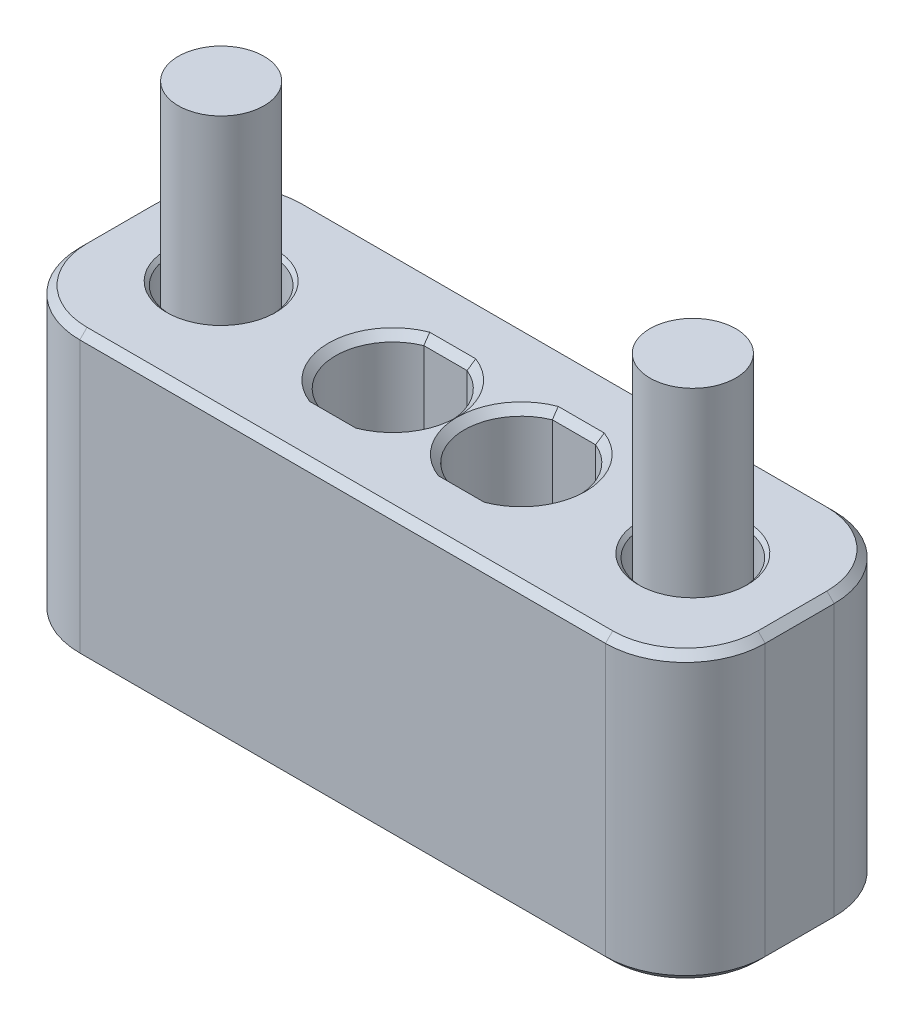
ISO-10303-21;
HEADER;
FILE_DESCRIPTION(('STEP AP214'),'2;1');
FILE_NAME('part.step','',(''),(''),'','','');
FILE_SCHEMA(('AUTOMOTIVE_DESIGN { 1 0 10303 214 1 1 1 1 }'));
ENDSEC;
DATA;
#1=APPLICATION_CONTEXT('core data for automotive mechanical design processes');
#2=APPLICATION_PROTOCOL_DEFINITION('international standard','automotive_design',2000,#1);
#3=PRODUCT_CONTEXT('',#1,'mechanical');
#4=PRODUCT('Part','Part','',(#3));
#5=PRODUCT_RELATED_PRODUCT_CATEGORY('part','',(#4));
#6=PRODUCT_DEFINITION_FORMATION('','',#4);
#7=PRODUCT_DEFINITION_CONTEXT('part definition',#1,'design');
#8=PRODUCT_DEFINITION('design','',#6,#7);
#9=PRODUCT_DEFINITION_SHAPE('','',#8);
#10=(LENGTH_UNIT() NAMED_UNIT(*) SI_UNIT(.MILLI.,.METRE.));
#11=(NAMED_UNIT(*) PLANE_ANGLE_UNIT() SI_UNIT($,.RADIAN.));
#12=(NAMED_UNIT(*) SI_UNIT($,.STERADIAN.) SOLID_ANGLE_UNIT());
#13=UNCERTAINTY_MEASURE_WITH_UNIT(LENGTH_MEASURE(1.E-05),#10,'distance_accuracy_value','');
#14=(GEOMETRIC_REPRESENTATION_CONTEXT(3) GLOBAL_UNCERTAINTY_ASSIGNED_CONTEXT((#13)) GLOBAL_UNIT_ASSIGNED_CONTEXT((#10,
#11,#12)) REPRESENTATION_CONTEXT('',''));
#15=CARTESIAN_POINT('',(0.,0.,0.));
#16=DIRECTION('',(0.,0.,1.));
#17=DIRECTION('',(1.,0.,0.));
#18=AXIS2_PLACEMENT_3D('',#15,#16,#17);
#19=CARTESIAN_POINT('',(16.5,32.112,0.));
#20=DIRECTION('',(0.,1.,0.));
#21=DIRECTION('',(-1.,0.,0.));
#22=AXIS2_PLACEMENT_3D('',#19,#20,#21);
#23=PLANE('',#22);
#24=CARTESIAN_POINT('',(16.5,32.112,0.));
#25=DIRECTION('',(0.,-1.,0.));
#26=DIRECTION('',(-1.,0.,0.));
#27=AXIS2_PLACEMENT_3D('',#24,#25,#26);
#28=CIRCLE('',#27,3.);
#29=CARTESIAN_POINT('',(13.5,32.112,0.));
#30=VERTEX_POINT('',#29);
#31=EDGE_CURVE('E12',#30,#30,#28,.T.);
#32=ORIENTED_EDGE('',*,*,#31,.F.);
#33=EDGE_LOOP('',(#32));
#34=FACE_BOUND('',#33,.T.);
#35=ADVANCED_FACE('F47',(#34),#23,.T.);
#36=CARTESIAN_POINT('',(16.5,32.112,0.));
#37=DIRECTION('',(0.,1.,0.));
#38=DIRECTION('',(-1.,0.,0.));
#39=AXIS2_PLACEMENT_3D('',#36,#37,#38);
#40=CYLINDRICAL_SURFACE('',#39,3.);
#41=CARTESIAN_POINT('',(16.5,7.112,0.));
#42=DIRECTION('',(0.,-1.,0.));
#43=DIRECTION('',(-1.,0.,0.));
#44=AXIS2_PLACEMENT_3D('',#41,#42,#43);
#45=CIRCLE('',#44,3.);
#46=CARTESIAN_POINT('',(13.5,7.112,0.));
#47=VERTEX_POINT('',#46);
#48=EDGE_CURVE('E54',#47,#47,#45,.T.);
#49=ORIENTED_EDGE('',*,*,#48,.F.);
#50=EDGE_LOOP('',(#49));
#51=FACE_BOUND('',#50,.T.);
#52=ORIENTED_EDGE('',*,*,#31,.T.);
#53=EDGE_LOOP('',(#52));
#54=FACE_BOUND('',#53,.T.);
#55=ADVANCED_FACE('F146',(#51,#54),#40,.T.);
#56=CARTESIAN_POINT('',(16.5,7.112,3.));
#57=DIRECTION('',(0.,1.,0.));
#58=DIRECTION('',(-1.,0.,0.));
#59=AXIS2_PLACEMENT_3D('',#56,#57,#58);
#60=PLANE('',#59);
#61=CARTESIAN_POINT('',(16.5,7.112,0.));
#62=DIRECTION('',(0.,-1.,0.));
#63=DIRECTION('',(-1.,0.,0.));
#64=AXIS2_PLACEMENT_3D('',#61,#62,#63);
#65=CIRCLE('',#64,5.);
#66=CARTESIAN_POINT('',(11.5,7.112,0.));
#67=VERTEX_POINT('',#66);
#68=EDGE_CURVE('E139',#67,#67,#65,.T.);
#69=ORIENTED_EDGE('',*,*,#68,.F.);
#70=EDGE_LOOP('',(#69));
#71=FACE_BOUND('',#70,.T.);
#72=ORIENTED_EDGE('',*,*,#48,.T.);
#73=EDGE_LOOP('',(#72));
#74=FACE_BOUND('',#73,.T.);
#75=ADVANCED_FACE('F144',(#71,#74),#60,.T.);
#76=CARTESIAN_POINT('',(16.5,32.112,0.));
#77=DIRECTION('',(0.,1.,0.));
#78=DIRECTION('',(-1.,0.,0.));
#79=AXIS2_PLACEMENT_3D('',#76,#77,#78);
#80=CYLINDRICAL_SURFACE('',#79,5.);
#81=CARTESIAN_POINT('',(16.5,1.112,0.));
#82=DIRECTION('',(0.,-1.,0.));
#83=DIRECTION('',(-1.,0.,0.));
#84=AXIS2_PLACEMENT_3D('',#81,#82,#83);
#85=CIRCLE('',#84,5.);
#86=CARTESIAN_POINT('',(11.5,1.112,0.));
#87=VERTEX_POINT('',#86);
#88=EDGE_CURVE('E136',#87,#87,#85,.T.);
#89=ORIENTED_EDGE('',*,*,#88,.F.);
#90=EDGE_LOOP('',(#89));
#91=FACE_BOUND('',#90,.T.);
#92=ORIENTED_EDGE('',*,*,#68,.T.);
#93=EDGE_LOOP('',(#92));
#94=FACE_BOUND('',#93,.T.);
#95=ADVANCED_FACE('F164',(#91,#94),#80,.T.);
#96=CARTESIAN_POINT('',(16.5,1.112,5.));
#97=DIRECTION('',(0.,-1.,0.));
#98=DIRECTION('',(1.,0.,0.));
#99=AXIS2_PLACEMENT_3D('',#96,#97,#98);
#100=PLANE('',#99);
#101=DIRECTION('',(-0.866025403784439,0.,0.5));
#102=VECTOR('',#101,1.);
#103=CARTESIAN_POINT('',(16.5,1.112,-2.88675134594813));
#104=LINE('',#103,#102);
#105=CARTESIAN_POINT('',(16.5,1.112,-2.88675134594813));
#106=VERTEX_POINT('',#105);
#107=CARTESIAN_POINT('',(14.,1.112,-1.44337567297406));
#108=VERTEX_POINT('',#107);
#109=EDGE_CURVE('E262',#106,#108,#104,.T.);
#110=ORIENTED_EDGE('',*,*,#109,.T.);
#111=DIRECTION('',(0.,0.,1.));
#112=VECTOR('',#111,1.);
#113=CARTESIAN_POINT('',(14.,1.112,-1.44337567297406));
#114=LINE('',#113,#112);
#115=CARTESIAN_POINT('',(14.,1.112,1.44337567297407));
#116=VERTEX_POINT('',#115);
#117=EDGE_CURVE('E256',#108,#116,#114,.T.);
#118=ORIENTED_EDGE('',*,*,#117,.T.);
#119=DIRECTION('',(0.866025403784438,0.,0.5));
#120=VECTOR('',#119,1.);
#121=CARTESIAN_POINT('',(14.,1.112,1.44337567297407));
#122=LINE('',#121,#120);
#123=CARTESIAN_POINT('',(16.5,1.112,2.88675134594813));
#124=VERTEX_POINT('',#123);
#125=EDGE_CURVE('E261',#116,#124,#122,.T.);
#126=ORIENTED_EDGE('',*,*,#125,.T.);
#127=DIRECTION('',(0.866025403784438,0.,-0.5));
#128=VECTOR('',#127,1.);
#129=CARTESIAN_POINT('',(16.5,1.112,2.88675134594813));
#130=LINE('',#129,#128);
#131=CARTESIAN_POINT('',(19.,1.112,1.44337567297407));
#132=VERTEX_POINT('',#131);
#133=EDGE_CURVE('E270',#124,#132,#130,.T.);
#134=ORIENTED_EDGE('',*,*,#133,.T.);
#135=DIRECTION('',(0.,0.,-1.));
#136=VECTOR('',#135,1.);
#137=CARTESIAN_POINT('',(19.,1.112,1.44337567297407));
#138=LINE('',#137,#136);
#139=CARTESIAN_POINT('',(19.,1.112,-1.44337567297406));
#140=VERTEX_POINT('',#139);
#141=EDGE_CURVE('E125',#132,#140,#138,.T.);
#142=ORIENTED_EDGE('',*,*,#141,.T.);
#143=DIRECTION('',(-0.866025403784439,0.,-0.5));
#144=VECTOR('',#143,1.);
#145=CARTESIAN_POINT('',(19.,1.112,-1.44337567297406));
#146=LINE('',#145,#144);
#147=EDGE_CURVE('E265',#140,#106,#146,.T.);
#148=ORIENTED_EDGE('',*,*,#147,.T.);
#149=EDGE_LOOP('',(#110,#118,#126,#134,#142,#148));
#150=FACE_BOUND('',#149,.T.);
#151=ORIENTED_EDGE('',*,*,#88,.T.);
#152=EDGE_LOOP('',(#151));
#153=FACE_BOUND('',#152,.T.);
#154=ADVANCED_FACE('F172',(#150,#153),#100,.T.);
#155=CARTESIAN_POINT('',(16.5,6.112,-2.88675134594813));
#156=DIRECTION('',(-0.5,0.,-0.866025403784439));
#157=DIRECTION('',(0.866025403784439,0.,-0.5));
#158=AXIS2_PLACEMENT_3D('',#155,#156,#157);
#159=PLANE('',#158);
#160=ORIENTED_EDGE('',*,*,#109,.F.);
#161=DIRECTION('',(0.,-1.,0.));
#162=VECTOR('',#161,1.);
#163=CARTESIAN_POINT('',(16.5,6.112,-2.88675134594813));
#164=LINE('',#163,#162);
#165=CARTESIAN_POINT('',(16.5,6.112,-2.88675134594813));
#166=VERTEX_POINT('',#165);
#167=EDGE_CURVE('E92',#166,#106,#164,.T.);
#168=ORIENTED_EDGE('',*,*,#167,.F.);
#169=DIRECTION('',(-0.866025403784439,0.,0.5));
#170=VECTOR('',#169,1.);
#171=CARTESIAN_POINT('',(16.5,6.112,-2.88675134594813));
#172=LINE('',#171,#170);
#173=CARTESIAN_POINT('',(14.,6.112,-1.44337567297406));
#174=VERTEX_POINT('',#173);
#175=EDGE_CURVE('E273',#166,#174,#172,.T.);
#176=ORIENTED_EDGE('',*,*,#175,.T.);
#177=DIRECTION('',(0.,-1.,0.));
#178=VECTOR('',#177,1.);
#179=CARTESIAN_POINT('',(14.,6.112,-1.44337567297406));
#180=LINE('',#179,#178);
#181=EDGE_CURVE('E61',#174,#108,#180,.T.);
#182=ORIENTED_EDGE('',*,*,#181,.T.);
#183=EDGE_LOOP('',(#160,#168,#176,#182));
#184=FACE_BOUND('',#183,.T.);
#185=ADVANCED_FACE('F180',(#184),#159,.F.);
#186=CARTESIAN_POINT('',(19.,6.112,-1.44337567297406));
#187=DIRECTION('',(0.5,0.,-0.866025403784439));
#188=DIRECTION('',(0.866025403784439,0.,0.5));
#189=AXIS2_PLACEMENT_3D('',#186,#187,#188);
#190=PLANE('',#189);
#191=ORIENTED_EDGE('',*,*,#147,.F.);
#192=DIRECTION('',(0.,-1.,0.));
#193=VECTOR('',#192,1.);
#194=CARTESIAN_POINT('',(19.,6.112,-1.44337567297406));
#195=LINE('',#194,#193);
#196=CARTESIAN_POINT('',(19.,6.112,-1.44337567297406));
#197=VERTEX_POINT('',#196);
#198=EDGE_CURVE('E127',#197,#140,#195,.T.);
#199=ORIENTED_EDGE('',*,*,#198,.F.);
#200=DIRECTION('',(-0.866025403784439,0.,-0.5));
#201=VECTOR('',#200,1.);
#202=CARTESIAN_POINT('',(19.,6.112,-1.44337567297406));
#203=LINE('',#202,#201);
#204=EDGE_CURVE('E70',#197,#166,#203,.T.);
#205=ORIENTED_EDGE('',*,*,#204,.T.);
#206=ORIENTED_EDGE('',*,*,#167,.T.);
#207=EDGE_LOOP('',(#191,#199,#205,#206));
#208=FACE_BOUND('',#207,.T.);
#209=ADVANCED_FACE('F188',(#208),#190,.F.);
#210=CARTESIAN_POINT('',(19.,6.112,1.44337567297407));
#211=DIRECTION('',(1.,0.,0.));
#212=DIRECTION('',(0.,0.,1.));
#213=AXIS2_PLACEMENT_3D('',#210,#211,#212);
#214=PLANE('',#213);
#215=ORIENTED_EDGE('',*,*,#141,.F.);
#216=DIRECTION('',(0.,-1.,0.));
#217=VECTOR('',#216,1.);
#218=CARTESIAN_POINT('',(19.,6.112,1.44337567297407));
#219=LINE('',#218,#217);
#220=CARTESIAN_POINT('',(19.,6.112,1.44337567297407));
#221=VERTEX_POINT('',#220);
#222=EDGE_CURVE('E114',#221,#132,#219,.T.);
#223=ORIENTED_EDGE('',*,*,#222,.F.);
#224=DIRECTION('',(0.,0.,-1.));
#225=VECTOR('',#224,1.);
#226=CARTESIAN_POINT('',(19.,6.112,1.44337567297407));
#227=LINE('',#226,#225);
#228=EDGE_CURVE('E117',#221,#197,#227,.T.);
#229=ORIENTED_EDGE('',*,*,#228,.T.);
#230=ORIENTED_EDGE('',*,*,#198,.T.);
#231=EDGE_LOOP('',(#215,#223,#229,#230));
#232=FACE_BOUND('',#231,.T.);
#233=ADVANCED_FACE('F123',(#232),#214,.F.);
#234=CARTESIAN_POINT('',(16.5,6.112,2.88675134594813));
#235=DIRECTION('',(0.5,0.,0.866025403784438));
#236=DIRECTION('',(-0.866025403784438,0.,0.5));
#237=AXIS2_PLACEMENT_3D('',#234,#235,#236);
#238=PLANE('',#237);
#239=ORIENTED_EDGE('',*,*,#133,.F.);
#240=DIRECTION('',(0.,-1.,0.));
#241=VECTOR('',#240,1.);
#242=CARTESIAN_POINT('',(16.5,6.112,2.88675134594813));
#243=LINE('',#242,#241);
#244=CARTESIAN_POINT('',(16.5,6.112,2.88675134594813));
#245=VERTEX_POINT('',#244);
#246=EDGE_CURVE('E116',#245,#124,#243,.T.);
#247=ORIENTED_EDGE('',*,*,#246,.F.);
#248=DIRECTION('',(0.866025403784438,0.,-0.5));
#249=VECTOR('',#248,1.);
#250=CARTESIAN_POINT('',(16.5,6.112,2.88675134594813));
#251=LINE('',#250,#249);
#252=EDGE_CURVE('E109',#245,#221,#251,.T.);
#253=ORIENTED_EDGE('',*,*,#252,.T.);
#254=ORIENTED_EDGE('',*,*,#222,.T.);
#255=EDGE_LOOP('',(#239,#247,#253,#254));
#256=FACE_BOUND('',#255,.T.);
#257=ADVANCED_FACE('F112',(#256),#238,.F.);
#258=CARTESIAN_POINT('',(14.,6.112,1.44337567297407));
#259=DIRECTION('',(-0.5,0.,0.866025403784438));
#260=DIRECTION('',(-0.866025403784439,0.,-0.5));
#261=AXIS2_PLACEMENT_3D('',#258,#259,#260);
#262=PLANE('',#261);
#263=ORIENTED_EDGE('',*,*,#125,.F.);
#264=DIRECTION('',(0.,-1.,0.));
#265=VECTOR('',#264,1.);
#266=CARTESIAN_POINT('',(14.,6.112,1.44337567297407));
#267=LINE('',#266,#265);
#268=CARTESIAN_POINT('',(14.,6.112,1.44337567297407));
#269=VERTEX_POINT('',#268);
#270=EDGE_CURVE('E130',#269,#116,#267,.T.);
#271=ORIENTED_EDGE('',*,*,#270,.F.);
#272=DIRECTION('',(0.866025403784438,0.,0.5));
#273=VECTOR('',#272,1.);
#274=CARTESIAN_POINT('',(14.,6.112,1.44337567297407));
#275=LINE('',#274,#273);
#276=EDGE_CURVE('E118',#269,#245,#275,.T.);
#277=ORIENTED_EDGE('',*,*,#276,.T.);
#278=ORIENTED_EDGE('',*,*,#246,.T.);
#279=EDGE_LOOP('',(#263,#271,#277,#278));
#280=FACE_BOUND('',#279,.T.);
#281=ADVANCED_FACE('F207',(#280),#262,.F.);
#282=CARTESIAN_POINT('',(14.,6.112,-1.44337567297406));
#283=DIRECTION('',(-1.,0.,0.));
#284=DIRECTION('',(0.,-1.,0.));
#285=AXIS2_PLACEMENT_3D('',#282,#283,#284);
#286=PLANE('',#285);
#287=ORIENTED_EDGE('',*,*,#117,.F.);
#288=ORIENTED_EDGE('',*,*,#181,.F.);
#289=DIRECTION('',(0.,0.,1.));
#290=VECTOR('',#289,1.);
#291=CARTESIAN_POINT('',(14.,6.112,-1.44337567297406));
#292=LINE('',#291,#290);
#293=EDGE_CURVE('E100',#174,#269,#292,.T.);
#294=ORIENTED_EDGE('',*,*,#293,.T.);
#295=ORIENTED_EDGE('',*,*,#270,.T.);
#296=EDGE_LOOP('',(#287,#288,#294,#295));
#297=FACE_BOUND('',#296,.T.);
#298=ADVANCED_FACE('F214',(#297),#286,.F.);
#299=CARTESIAN_POINT('',(11.5,6.112,0.));
#300=DIRECTION('',(0.,-1.,0.));
#301=DIRECTION('',(1.,0.,0.));
#302=AXIS2_PLACEMENT_3D('',#299,#300,#301);
#303=PLANE('',#302);
#304=ORIENTED_EDGE('',*,*,#175,.F.);
#305=ORIENTED_EDGE('',*,*,#204,.F.);
#306=ORIENTED_EDGE('',*,*,#228,.F.);
#307=ORIENTED_EDGE('',*,*,#252,.F.);
#308=ORIENTED_EDGE('',*,*,#276,.F.);
#309=ORIENTED_EDGE('',*,*,#293,.F.);
#310=EDGE_LOOP('',(#304,#305,#306,#307,#308,#309));
#311=FACE_BOUND('',#310,.T.);
#312=ADVANCED_FACE('F120',(#311),#303,.T.);
#313=CLOSED_SHELL('',(#35,#55,#75,#95,#154,#185,#209,#233,#257,#281,#298,#312));
#314=MANIFOLD_SOLID_BREP('B2',#313);
#315=CARTESIAN_POINT('',(-16.5,32.112,0.));
#316=DIRECTION('',(0.,1.,0.));
#317=DIRECTION('',(1.,0.,0.));
#318=AXIS2_PLACEMENT_3D('',#315,#316,#317);
#319=PLANE('',#318);
#320=CARTESIAN_POINT('',(-16.5,32.112,0.));
#321=DIRECTION('',(0.,1.,0.));
#322=DIRECTION('',(1.,0.,0.));
#323=AXIS2_PLACEMENT_3D('',#320,#321,#322);
#324=CIRCLE('',#323,3.);
#325=CARTESIAN_POINT('',(-13.5,32.112,0.));
#326=VERTEX_POINT('',#325);
#327=EDGE_CURVE('E45',#326,#326,#324,.T.);
#328=ORIENTED_EDGE('',*,*,#327,.T.);
#329=EDGE_LOOP('',(#328));
#330=FACE_BOUND('',#329,.T.);
#331=ADVANCED_FACE('F292',(#330),#319,.T.);
#332=CARTESIAN_POINT('',(-16.5,32.112,0.));
#333=DIRECTION('',(0.,1.,0.));
#334=DIRECTION('',(1.,0.,0.));
#335=AXIS2_PLACEMENT_3D('',#332,#333,#334);
#336=CYLINDRICAL_SURFACE('',#335,3.);
#337=CARTESIAN_POINT('',(-16.5,7.112,0.));
#338=DIRECTION('',(0.,1.,0.));
#339=DIRECTION('',(1.,0.,0.));
#340=AXIS2_PLACEMENT_3D('',#337,#338,#339);
#341=CIRCLE('',#340,3.);
#342=CARTESIAN_POINT('',(-13.5,7.112,0.));
#343=VERTEX_POINT('',#342);
#344=EDGE_CURVE('E299',#343,#343,#341,.T.);
#345=ORIENTED_EDGE('',*,*,#344,.T.);
#346=EDGE_LOOP('',(#345));
#347=FACE_BOUND('',#346,.T.);
#348=ORIENTED_EDGE('',*,*,#327,.F.);
#349=EDGE_LOOP('',(#348));
#350=FACE_BOUND('',#349,.T.);
#351=ADVANCED_FACE('F406',(#347,#350),#336,.T.);
#352=CARTESIAN_POINT('',(-16.5,7.112,3.));
#353=DIRECTION('',(0.,1.,0.));
#354=DIRECTION('',(1.,0.,0.));
#355=AXIS2_PLACEMENT_3D('',#352,#353,#354);
#356=PLANE('',#355);
#357=CARTESIAN_POINT('',(-16.5,7.112,0.));
#358=DIRECTION('',(0.,1.,0.));
#359=DIRECTION('',(1.,0.,0.));
#360=AXIS2_PLACEMENT_3D('',#357,#358,#359);
#361=CIRCLE('',#360,5.);
#362=CARTESIAN_POINT('',(-11.5,7.112,0.));
#363=VERTEX_POINT('',#362);
#364=EDGE_CURVE('E401',#363,#363,#361,.T.);
#365=ORIENTED_EDGE('',*,*,#364,.T.);
#366=EDGE_LOOP('',(#365));
#367=FACE_BOUND('',#366,.T.);
#368=ORIENTED_EDGE('',*,*,#344,.F.);
#369=EDGE_LOOP('',(#368));
#370=FACE_BOUND('',#369,.T.);
#371=ADVANCED_FACE('F409',(#367,#370),#356,.T.);
#372=CARTESIAN_POINT('',(-16.5,32.112,0.));
#373=DIRECTION('',(0.,1.,0.));
#374=DIRECTION('',(1.,0.,0.));
#375=AXIS2_PLACEMENT_3D('',#372,#373,#374);
#376=CYLINDRICAL_SURFACE('',#375,5.);
#377=CARTESIAN_POINT('',(-16.5,1.112,0.));
#378=DIRECTION('',(0.,1.,0.));
#379=DIRECTION('',(1.,0.,0.));
#380=AXIS2_PLACEMENT_3D('',#377,#378,#379);
#381=CIRCLE('',#380,5.);
#382=CARTESIAN_POINT('',(-11.5,1.112,0.));
#383=VERTEX_POINT('',#382);
#384=EDGE_CURVE('E393',#383,#383,#381,.T.);
#385=ORIENTED_EDGE('',*,*,#384,.T.);
#386=EDGE_LOOP('',(#385));
#387=FACE_BOUND('',#386,.T.);
#388=ORIENTED_EDGE('',*,*,#364,.F.);
#389=EDGE_LOOP('',(#388));
#390=FACE_BOUND('',#389,.T.);
#391=ADVANCED_FACE('F411',(#387,#390),#376,.T.);
#392=CARTESIAN_POINT('',(-16.5,1.112,5.));
#393=DIRECTION('',(0.,-1.,0.));
#394=DIRECTION('',(-1.,0.,0.));
#395=AXIS2_PLACEMENT_3D('',#392,#393,#394);
#396=PLANE('',#395);
#397=DIRECTION('',(0.866025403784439,0.,0.5));
#398=VECTOR('',#397,1.);
#399=CARTESIAN_POINT('',(-16.5,1.112,-2.88675134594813));
#400=LINE('',#399,#398);
#401=CARTESIAN_POINT('',(-16.5,1.112,-2.88675134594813));
#402=VERTEX_POINT('',#401);
#403=CARTESIAN_POINT('',(-14.,1.112,-1.44337567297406));
#404=VERTEX_POINT('',#403);
#405=EDGE_CURVE('E306',#402,#404,#400,.T.);
#406=ORIENTED_EDGE('',*,*,#405,.F.);
#407=DIRECTION('',(0.866025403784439,0.,-0.5));
#408=VECTOR('',#407,1.);
#409=CARTESIAN_POINT('',(-19.,1.112,-1.44337567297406));
#410=LINE('',#409,#408);
#411=CARTESIAN_POINT('',(-19.,1.112,-1.44337567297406));
#412=VERTEX_POINT('',#411);
#413=EDGE_CURVE('E389',#412,#402,#410,.T.);
#414=ORIENTED_EDGE('',*,*,#413,.F.);
#415=DIRECTION('',(0.,0.,-1.));
#416=VECTOR('',#415,1.);
#417=CARTESIAN_POINT('',(-19.,1.112,1.44337567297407));
#418=LINE('',#417,#416);
#419=CARTESIAN_POINT('',(-19.,1.112,1.44337567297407));
#420=VERTEX_POINT('',#419);
#421=EDGE_CURVE('E387',#420,#412,#418,.T.);
#422=ORIENTED_EDGE('',*,*,#421,.F.);
#423=DIRECTION('',(-0.866025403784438,0.,-0.5));
#424=VECTOR('',#423,1.);
#425=CARTESIAN_POINT('',(-16.5,1.112,2.88675134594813));
#426=LINE('',#425,#424);
#427=CARTESIAN_POINT('',(-16.5,1.112,2.88675134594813));
#428=VERTEX_POINT('',#427);
#429=EDGE_CURVE('E354',#428,#420,#426,.T.);
#430=ORIENTED_EDGE('',*,*,#429,.F.);
#431=DIRECTION('',(-0.866025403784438,0.,0.5));
#432=VECTOR('',#431,1.);
#433=CARTESIAN_POINT('',(-14.,1.112,1.44337567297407));
#434=LINE('',#433,#432);
#435=CARTESIAN_POINT('',(-14.,1.112,1.44337567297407));
#436=VERTEX_POINT('',#435);
#437=EDGE_CURVE('E383',#436,#428,#434,.T.);
#438=ORIENTED_EDGE('',*,*,#437,.F.);
#439=DIRECTION('',(0.,0.,1.));
#440=VECTOR('',#439,1.);
#441=CARTESIAN_POINT('',(-14.,1.112,-1.44337567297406));
#442=LINE('',#441,#440);
#443=EDGE_CURVE('E380',#404,#436,#442,.T.);
#444=ORIENTED_EDGE('',*,*,#443,.F.);
#445=EDGE_LOOP('',(#406,#414,#422,#430,#438,#444));
#446=FACE_BOUND('',#445,.T.);
#447=ORIENTED_EDGE('',*,*,#384,.F.);
#448=EDGE_LOOP('',(#447));
#449=FACE_BOUND('',#448,.T.);
#450=ADVANCED_FACE('F418',(#446,#449),#396,.T.);
#451=CARTESIAN_POINT('',(-16.5,6.112,-2.88675134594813));
#452=DIRECTION('',(0.5,0.,-0.866025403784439));
#453=DIRECTION('',(-0.866025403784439,0.,-0.5));
#454=AXIS2_PLACEMENT_3D('',#451,#452,#453);
#455=PLANE('',#454);
#456=ORIENTED_EDGE('',*,*,#405,.T.);
#457=DIRECTION('',(0.,-1.,0.));
#458=VECTOR('',#457,1.);
#459=CARTESIAN_POINT('',(-14.,6.112,-1.44337567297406));
#460=LINE('',#459,#458);
#461=CARTESIAN_POINT('',(-14.,6.112,-1.44337567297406));
#462=VERTEX_POINT('',#461);
#463=EDGE_CURVE('E336',#462,#404,#460,.T.);
#464=ORIENTED_EDGE('',*,*,#463,.F.);
#465=DIRECTION('',(0.866025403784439,0.,0.5));
#466=VECTOR('',#465,1.);
#467=CARTESIAN_POINT('',(-16.5,6.112,-2.88675134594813));
#468=LINE('',#467,#466);
#469=CARTESIAN_POINT('',(-16.5,6.112,-2.88675134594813));
#470=VERTEX_POINT('',#469);
#471=EDGE_CURVE('E391',#470,#462,#468,.T.);
#472=ORIENTED_EDGE('',*,*,#471,.F.);
#473=DIRECTION('',(0.,-1.,0.));
#474=VECTOR('',#473,1.);
#475=CARTESIAN_POINT('',(-16.5,6.112,-2.88675134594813));
#476=LINE('',#475,#474);
#477=EDGE_CURVE('E314',#470,#402,#476,.T.);
#478=ORIENTED_EDGE('',*,*,#477,.T.);
#479=EDGE_LOOP('',(#456,#464,#472,#478));
#480=FACE_BOUND('',#479,.T.);
#481=ADVANCED_FACE('F443',(#480),#455,.F.);
#482=CARTESIAN_POINT('',(-19.,6.112,-1.44337567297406));
#483=DIRECTION('',(-0.5,0.,-0.866025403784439));
#484=DIRECTION('',(-0.866025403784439,0.,0.5));
#485=AXIS2_PLACEMENT_3D('',#482,#483,#484);
#486=PLANE('',#485);
#487=ORIENTED_EDGE('',*,*,#413,.T.);
#488=ORIENTED_EDGE('',*,*,#477,.F.);
#489=DIRECTION('',(0.866025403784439,0.,-0.5));
#490=VECTOR('',#489,1.);
#491=CARTESIAN_POINT('',(-19.,6.112,-1.44337567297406));
#492=LINE('',#491,#490);
#493=CARTESIAN_POINT('',(-19.,6.112,-1.44337567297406));
#494=VERTEX_POINT('',#493);
#495=EDGE_CURVE('E366',#494,#470,#492,.T.);
#496=ORIENTED_EDGE('',*,*,#495,.F.);
#497=DIRECTION('',(0.,-1.,0.));
#498=VECTOR('',#497,1.);
#499=CARTESIAN_POINT('',(-19.,6.112,-1.44337567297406));
#500=LINE('',#499,#498);
#501=EDGE_CURVE('E358',#494,#412,#500,.T.);
#502=ORIENTED_EDGE('',*,*,#501,.T.);
#503=EDGE_LOOP('',(#487,#488,#496,#502));
#504=FACE_BOUND('',#503,.T.);
#505=ADVANCED_FACE('F451',(#504),#486,.F.);
#506=CARTESIAN_POINT('',(-19.,6.112,1.44337567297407));
#507=DIRECTION('',(-1.,0.,0.));
#508=DIRECTION('',(0.,0.,1.));
#509=AXIS2_PLACEMENT_3D('',#506,#507,#508);
#510=PLANE('',#509);
#511=ORIENTED_EDGE('',*,*,#421,.T.);
#512=ORIENTED_EDGE('',*,*,#501,.F.);
#513=DIRECTION('',(0.,0.,-1.));
#514=VECTOR('',#513,1.);
#515=CARTESIAN_POINT('',(-19.,6.112,1.44337567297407));
#516=LINE('',#515,#514);
#517=CARTESIAN_POINT('',(-19.,6.112,1.44337567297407));
#518=VERTEX_POINT('',#517);
#519=EDGE_CURVE('E362',#518,#494,#516,.T.);
#520=ORIENTED_EDGE('',*,*,#519,.F.);
#521=DIRECTION('',(0.,-1.,0.));
#522=VECTOR('',#521,1.);
#523=CARTESIAN_POINT('',(-19.,6.112,1.44337567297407));
#524=LINE('',#523,#522);
#525=EDGE_CURVE('E347',#518,#420,#524,.T.);
#526=ORIENTED_EDGE('',*,*,#525,.T.);
#527=EDGE_LOOP('',(#511,#512,#520,#526));
#528=FACE_BOUND('',#527,.T.);
#529=ADVANCED_FACE('F363',(#528),#510,.F.);
#530=CARTESIAN_POINT('',(-16.5,6.112,2.88675134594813));
#531=DIRECTION('',(-0.5,0.,0.866025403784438));
#532=DIRECTION('',(0.866025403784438,0.,0.5));
#533=AXIS2_PLACEMENT_3D('',#530,#531,#532);
#534=PLANE('',#533);
#535=ORIENTED_EDGE('',*,*,#429,.T.);
#536=ORIENTED_EDGE('',*,*,#525,.F.);
#537=DIRECTION('',(-0.866025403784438,0.,-0.5));
#538=VECTOR('',#537,1.);
#539=CARTESIAN_POINT('',(-16.5,6.112,2.88675134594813));
#540=LINE('',#539,#538);
#541=CARTESIAN_POINT('',(-16.5,6.112,2.88675134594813));
#542=VERTEX_POINT('',#541);
#543=EDGE_CURVE('E351',#542,#518,#540,.T.);
#544=ORIENTED_EDGE('',*,*,#543,.F.);
#545=DIRECTION('',(0.,-1.,0.));
#546=VECTOR('',#545,1.);
#547=CARTESIAN_POINT('',(-16.5,6.112,2.88675134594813));
#548=LINE('',#547,#546);
#549=EDGE_CURVE('E359',#542,#428,#548,.T.);
#550=ORIENTED_EDGE('',*,*,#549,.T.);
#551=EDGE_LOOP('',(#535,#536,#544,#550));
#552=FACE_BOUND('',#551,.T.);
#553=ADVANCED_FACE('F349',(#552),#534,.F.);
#554=CARTESIAN_POINT('',(-14.,6.112,1.44337567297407));
#555=DIRECTION('',(0.5,0.,0.866025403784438));
#556=DIRECTION('',(0.866025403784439,0.,-0.5));
#557=AXIS2_PLACEMENT_3D('',#554,#555,#556);
#558=PLANE('',#557);
#559=ORIENTED_EDGE('',*,*,#437,.T.);
#560=ORIENTED_EDGE('',*,*,#549,.F.);
#561=DIRECTION('',(-0.866025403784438,0.,0.5));
#562=VECTOR('',#561,1.);
#563=CARTESIAN_POINT('',(-14.,6.112,1.44337567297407));
#564=LINE('',#563,#562);
#565=CARTESIAN_POINT('',(-14.,6.112,1.44337567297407));
#566=VERTEX_POINT('',#565);
#567=EDGE_CURVE('E372',#566,#542,#564,.T.);
#568=ORIENTED_EDGE('',*,*,#567,.F.);
#569=DIRECTION('',(0.,-1.,0.));
#570=VECTOR('',#569,1.);
#571=CARTESIAN_POINT('',(-14.,6.112,1.44337567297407));
#572=LINE('',#571,#570);
#573=EDGE_CURVE('E396',#566,#436,#572,.T.);
#574=ORIENTED_EDGE('',*,*,#573,.T.);
#575=EDGE_LOOP('',(#559,#560,#568,#574));
#576=FACE_BOUND('',#575,.T.);
#577=ADVANCED_FACE('F470',(#576),#558,.F.);
#578=CARTESIAN_POINT('',(-14.,6.112,-1.44337567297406));
#579=DIRECTION('',(1.,0.,0.));
#580=DIRECTION('',(0.,-1.,0.));
#581=AXIS2_PLACEMENT_3D('',#578,#579,#580);
#582=PLANE('',#581);
#583=ORIENTED_EDGE('',*,*,#443,.T.);
#584=ORIENTED_EDGE('',*,*,#573,.F.);
#585=DIRECTION('',(0.,0.,1.));
#586=VECTOR('',#585,1.);
#587=CARTESIAN_POINT('',(-14.,6.112,-1.44337567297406));
#588=LINE('',#587,#586);
#589=EDGE_CURVE('E374',#462,#566,#588,.T.);
#590=ORIENTED_EDGE('',*,*,#589,.F.);
#591=ORIENTED_EDGE('',*,*,#463,.T.);
#592=EDGE_LOOP('',(#583,#584,#590,#591));
#593=FACE_BOUND('',#592,.T.);
#594=ADVANCED_FACE('F477',(#593),#582,.F.);
#595=CARTESIAN_POINT('',(-11.5,6.112,0.));
#596=DIRECTION('',(0.,-1.,0.));
#597=DIRECTION('',(-1.,0.,0.));
#598=AXIS2_PLACEMENT_3D('',#595,#596,#597);
#599=PLANE('',#598);
#600=ORIENTED_EDGE('',*,*,#471,.T.);
#601=ORIENTED_EDGE('',*,*,#589,.T.);
#602=ORIENTED_EDGE('',*,*,#567,.T.);
#603=ORIENTED_EDGE('',*,*,#543,.T.);
#604=ORIENTED_EDGE('',*,*,#519,.T.);
#605=ORIENTED_EDGE('',*,*,#495,.T.);
#606=EDGE_LOOP('',(#600,#601,#602,#603,#604,#605));
#607=FACE_BOUND('',#606,.T.);
#608=ADVANCED_FACE('F369',(#607),#599,.T.);
#609=CLOSED_SHELL('',(#331,#351,#371,#391,#450,#481,#505,#529,#553,#577,#594,#608));
#610=MANIFOLD_SOLID_BREP('B6',#609);
#611=CARTESIAN_POINT('',(23.9776,19.9898,-8.001));
#612=DIRECTION('',(0.,-1.,0.));
#613=DIRECTION('',(0.,0.,-1.));
#614=AXIS2_PLACEMENT_3D('',#611,#612,#613);
#615=PLANE('',#614);
#616=CARTESIAN_POINT('',(-16.5,19.9898,0.));
#617=DIRECTION('',(0.,-1.,0.));
#618=DIRECTION('',(0.,0.,-1.));
#619=AXIS2_PLACEMENT_3D('',#616,#617,#618);
#620=CIRCLE('',#619,3.81);
#621=CARTESIAN_POINT('',(-16.5,19.9898,-3.81));
#622=VERTEX_POINT('',#621);
#623=EDGE_CURVE('E1010',#622,#622,#620,.T.);
#624=ORIENTED_EDGE('',*,*,#623,.T.);
#625=EDGE_LOOP('',(#624));
#626=FACE_BOUND('',#625,.T.);
#627=DIRECTION('',(-1.,0.,0.));
#628=VECTOR('',#627,1.);
#629=CARTESIAN_POINT('',(23.9776,19.9898,4.19735000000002));
#630=LINE('',#629,#628);
#631=CARTESIAN_POINT('',(6.10653604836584,19.9898,4.19734999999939));
#632=VERTEX_POINT('',#631);
#633=CARTESIAN_POINT('',(2.88506395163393,19.9898,4.19735000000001));
#634=VERTEX_POINT('',#633);
#635=EDGE_CURVE('E1133',#632,#634,#630,.T.);
#636=ORIENTED_EDGE('',*,*,#635,.T.);
#637=CARTESIAN_POINT('',(4.4958,19.9898,0.));
#638=DIRECTION('',(0.,-1.,0.));
#639=DIRECTION('',(0.,0.,-1.));
#640=AXIS2_PLACEMENT_3D('',#637,#638,#639);
#641=CIRCLE('',#640,4.49580000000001);
#642=CARTESIAN_POINT('',(0.,19.9898,0.));
#643=VERTEX_POINT('',#642);
#644=EDGE_CURVE('E1135',#634,#643,#641,.T.);
#645=ORIENTED_EDGE('',*,*,#644,.T.);
#646=CARTESIAN_POINT('',(-4.4958,19.9898,0.));
#647=DIRECTION('',(0.,-1.,0.));
#648=DIRECTION('',(0.,0.,-1.));
#649=AXIS2_PLACEMENT_3D('',#646,#647,#648);
#650=CIRCLE('',#649,4.49580000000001);
#651=CARTESIAN_POINT('',(-2.88506395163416,19.9898,4.19735000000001));
#652=VERTEX_POINT('',#651);
#653=EDGE_CURVE('E1121',#643,#652,#650,.T.);
#654=ORIENTED_EDGE('',*,*,#653,.T.);
#655=DIRECTION('',(-1.,0.,0.));
#656=VECTOR('',#655,1.);
#657=CARTESIAN_POINT('',(23.9776,19.9898,4.19735000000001));
#658=LINE('',#657,#656);
#659=CARTESIAN_POINT('',(-6.10653604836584,19.9898,4.19734999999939));
#660=VERTEX_POINT('',#659);
#661=EDGE_CURVE('E1119',#652,#660,#658,.T.);
#662=ORIENTED_EDGE('',*,*,#661,.T.);
#663=CARTESIAN_POINT('',(-4.4958,19.9898,0.));
#664=DIRECTION('',(0.,-1.,0.));
#665=DIRECTION('',(0.,0.,-1.));
#666=AXIS2_PLACEMENT_3D('',#663,#664,#665);
#667=CIRCLE('',#666,4.49580000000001);
#668=CARTESIAN_POINT('',(-6.10653604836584,19.9898,-4.19735000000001));
#669=VERTEX_POINT('',#668);
#670=EDGE_CURVE('E1117',#660,#669,#667,.T.);
#671=ORIENTED_EDGE('',*,*,#670,.T.);
#672=DIRECTION('',(1.,0.,0.));
#673=VECTOR('',#672,1.);
#674=CARTESIAN_POINT('',(23.9776,19.9898,-4.19735000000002));
#675=LINE('',#674,#673);
#676=CARTESIAN_POINT('',(-2.88506395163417,19.9898,-4.19735000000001));
#677=VERTEX_POINT('',#676);
#678=EDGE_CURVE('E1115',#669,#677,#675,.T.);
#679=ORIENTED_EDGE('',*,*,#678,.T.);
#680=CARTESIAN_POINT('',(-4.4958,19.9898,0.));
#681=DIRECTION('',(0.,-1.,0.));
#682=DIRECTION('',(0.,0.,-1.));
#683=AXIS2_PLACEMENT_3D('',#680,#681,#682);
#684=CIRCLE('',#683,4.49580000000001);
#685=EDGE_CURVE('E1123',#677,#643,#684,.T.);
#686=ORIENTED_EDGE('',*,*,#685,.T.);
#687=CARTESIAN_POINT('',(4.4958,19.9898,0.));
#688=DIRECTION('',(0.,-1.,0.));
#689=DIRECTION('',(0.,0.,-1.));
#690=AXIS2_PLACEMENT_3D('',#687,#688,#689);
#691=CIRCLE('',#690,4.49580000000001);
#692=CARTESIAN_POINT('',(2.88506395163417,19.9898,-4.19734999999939));
#693=VERTEX_POINT('',#692);
#694=EDGE_CURVE('E1126',#643,#693,#691,.T.);
#695=ORIENTED_EDGE('',*,*,#694,.T.);
#696=DIRECTION('',(1.,0.,0.));
#697=VECTOR('',#696,1.);
#698=CARTESIAN_POINT('',(23.9776,19.9898,-4.19735000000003));
#699=LINE('',#698,#697);
#700=CARTESIAN_POINT('',(6.10653604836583,19.9898,-4.19735000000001));
#701=VERTEX_POINT('',#700);
#702=EDGE_CURVE('E1128',#693,#701,#699,.T.);
#703=ORIENTED_EDGE('',*,*,#702,.T.);
#704=CARTESIAN_POINT('',(4.4958,19.9898,0.));
#705=DIRECTION('',(0.,-1.,0.));
#706=DIRECTION('',(0.,0.,-1.));
#707=AXIS2_PLACEMENT_3D('',#704,#705,#706);
#708=CIRCLE('',#707,4.49580000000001);
#709=EDGE_CURVE('E1130',#701,#632,#708,.T.);
#710=ORIENTED_EDGE('',*,*,#709,.T.);
#711=EDGE_LOOP('',(#636,#645,#654,#662,#671,#679,#686,#695,#703,#710));
#712=FACE_BOUND('',#711,.T.);
#713=CARTESIAN_POINT('',(18.3896,19.9898,-2.413));
#714=DIRECTION('',(0.,-1.,0.));
#715=DIRECTION('',(0.,0.,-1.));
#716=AXIS2_PLACEMENT_3D('',#713,#714,#715);
#717=CIRCLE('',#716,5.08000000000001);
#718=CARTESIAN_POINT('',(23.4696,19.9898,-2.413));
#719=VERTEX_POINT('',#718);
#720=CARTESIAN_POINT('',(18.3896,19.9898,-7.493));
#721=VERTEX_POINT('',#720);
#722=EDGE_CURVE('E527',#719,#721,#717,.F.);
#723=ORIENTED_EDGE('',*,*,#722,.T.);
#724=DIRECTION('',(-1.,0.,0.));
#725=VECTOR('',#724,1.);
#726=CARTESIAN_POINT('',(23.9776,19.9898,-7.493));
#727=LINE('',#726,#725);
#728=CARTESIAN_POINT('',(-18.3896,19.9898,-7.493));
#729=VERTEX_POINT('',#728);
#730=EDGE_CURVE('E290',#721,#729,#727,.T.);
#731=ORIENTED_EDGE('',*,*,#730,.T.);
#732=CARTESIAN_POINT('',(-18.3896,19.9898,-2.413));
#733=DIRECTION('',(0.,-1.,0.));
#734=DIRECTION('',(0.,0.,-1.));
#735=AXIS2_PLACEMENT_3D('',#732,#733,#734);
#736=CIRCLE('',#735,5.08);
#737=CARTESIAN_POINT('',(-23.4696,19.9898,-2.413));
#738=VERTEX_POINT('',#737);
#739=EDGE_CURVE('E512',#729,#738,#736,.F.);
#740=ORIENTED_EDGE('',*,*,#739,.T.);
#741=DIRECTION('',(0.,0.,1.));
#742=VECTOR('',#741,1.);
#743=CARTESIAN_POINT('',(-23.4696,19.9898,-8.001));
#744=LINE('',#743,#742);
#745=CARTESIAN_POINT('',(-23.4696,19.9898,2.413));
#746=VERTEX_POINT('',#745);
#747=EDGE_CURVE('E1208',#738,#746,#744,.T.);
#748=ORIENTED_EDGE('',*,*,#747,.T.);
#749=CARTESIAN_POINT('',(-18.3896,19.9898,2.413));
#750=DIRECTION('',(0.,-1.,0.));
#751=DIRECTION('',(0.,0.,-1.));
#752=AXIS2_PLACEMENT_3D('',#749,#750,#751);
#753=CIRCLE('',#752,5.08000000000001);
#754=CARTESIAN_POINT('',(-18.3896,19.9898,7.49300000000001));
#755=VERTEX_POINT('',#754);
#756=EDGE_CURVE('E1204',#746,#755,#753,.F.);
#757=ORIENTED_EDGE('',*,*,#756,.T.);
#758=DIRECTION('',(1.,0.,0.));
#759=VECTOR('',#758,1.);
#760=CARTESIAN_POINT('',(23.9776,19.9898,7.49300000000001));
#761=LINE('',#760,#759);
#762=CARTESIAN_POINT('',(18.3896,19.9898,7.49300000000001));
#763=VERTEX_POINT('',#762);
#764=EDGE_CURVE('E1200',#755,#763,#761,.T.);
#765=ORIENTED_EDGE('',*,*,#764,.T.);
#766=CARTESIAN_POINT('',(18.3896,19.9898,2.413));
#767=DIRECTION('',(0.,-1.,0.));
#768=DIRECTION('',(0.,0.,-1.));
#769=AXIS2_PLACEMENT_3D('',#766,#767,#768);
#770=CIRCLE('',#769,5.08);
#771=CARTESIAN_POINT('',(23.4696,19.9898,2.413));
#772=VERTEX_POINT('',#771);
#773=EDGE_CURVE('E1202',#763,#772,#770,.F.);
#774=ORIENTED_EDGE('',*,*,#773,.T.);
#775=DIRECTION('',(0.,0.,-1.));
#776=VECTOR('',#775,1.);
#777=CARTESIAN_POINT('',(23.4696,19.9898,-8.001));
#778=LINE('',#777,#776);
#779=EDGE_CURVE('E1206',#772,#719,#778,.T.);
#780=ORIENTED_EDGE('',*,*,#779,.T.);
#781=EDGE_LOOP('',(#723,#731,#740,#748,#757,#765,#774,#780));
#782=FACE_BOUND('',#781,.T.);
#783=CARTESIAN_POINT('',(16.5,19.9898,0.));
#784=DIRECTION('',(0.,1.,0.));
#785=DIRECTION('',(0.,0.,-1.));
#786=AXIS2_PLACEMENT_3D('',#783,#784,#785);
#787=CIRCLE('',#786,3.81);
#788=CARTESIAN_POINT('',(16.5,19.9898,-3.81));
#789=VERTEX_POINT('',#788);
#790=EDGE_CURVE('E1237',#789,#789,#787,.T.);
#791=ORIENTED_EDGE('',*,*,#790,.F.);
#792=EDGE_LOOP('',(#791));
#793=FACE_BOUND('',#792,.T.);
#794=ADVANCED_FACE('F503',(#626,#712,#782,#793),#615,.F.);
#795=CARTESIAN_POINT('',(23.9776,0.,-8.001));
#796=DIRECTION('',(0.,-1.,0.));
#797=DIRECTION('',(0.,0.,-1.));
#798=AXIS2_PLACEMENT_3D('',#795,#796,#797);
#799=PLANE('',#798);
#800=CARTESIAN_POINT('',(-16.5,0.,0.));
#801=DIRECTION('',(0.,-1.,0.));
#802=DIRECTION('',(0.,0.,-1.));
#803=AXIS2_PLACEMENT_3D('',#800,#801,#802);
#804=CIRCLE('',#803,5.6642);
#805=CARTESIAN_POINT('',(-16.5,0.,-5.6642));
#806=VERTEX_POINT('',#805);
#807=EDGE_CURVE('E1234',#806,#806,#804,.T.);
#808=ORIENTED_EDGE('',*,*,#807,.F.);
#809=EDGE_LOOP('',(#808));
#810=FACE_BOUND('',#809,.T.);
#811=DIRECTION('',(-1.,0.,0.));
#812=VECTOR('',#811,1.);
#813=CARTESIAN_POINT('',(2.98211396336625,0.,-4.19734999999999));
#814=LINE('',#813,#812);
#815=CARTESIAN_POINT('',(6.10653604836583,0.,-4.19735));
#816=VERTEX_POINT('',#815);
#817=CARTESIAN_POINT('',(2.88506395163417,0.,-4.19734999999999));
#818=VERTEX_POINT('',#817);
#819=EDGE_CURVE('E1088',#816,#818,#814,.T.);
#820=ORIENTED_EDGE('',*,*,#819,.T.);
#821=CARTESIAN_POINT('',(4.4958,0.,0.));
#822=DIRECTION('',(0.,-1.,0.));
#823=DIRECTION('',(0.,0.,-1.));
#824=AXIS2_PLACEMENT_3D('',#821,#822,#823);
#825=CIRCLE('',#824,4.49579999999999);
#826=CARTESIAN_POINT('',(0.,0.,0.));
#827=VERTEX_POINT('',#826);
#828=EDGE_CURVE('E729',#818,#827,#825,.F.);
#829=ORIENTED_EDGE('',*,*,#828,.T.);
#830=CARTESIAN_POINT('',(-4.4958,0.,0.));
#831=DIRECTION('',(0.,-1.,0.));
#832=DIRECTION('',(0.,0.,-1.));
#833=AXIS2_PLACEMENT_3D('',#830,#831,#832);
#834=CIRCLE('',#833,4.49579999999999);
#835=CARTESIAN_POINT('',(-2.88506395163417,0.,-4.19734999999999));
#836=VERTEX_POINT('',#835);
#837=EDGE_CURVE('E722',#827,#836,#834,.F.);
#838=ORIENTED_EDGE('',*,*,#837,.T.);
#839=DIRECTION('',(-1.,0.,0.));
#840=VECTOR('',#839,1.);
#841=CARTESIAN_POINT('',(-6.00948603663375,0.,-4.19734999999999));
#842=LINE('',#841,#840);
#843=CARTESIAN_POINT('',(-6.10653604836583,0.,-4.19734999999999));
#844=VERTEX_POINT('',#843);
#845=EDGE_CURVE('E726',#836,#844,#842,.T.);
#846=ORIENTED_EDGE('',*,*,#845,.T.);
#847=CARTESIAN_POINT('',(-4.4958,0.,0.));
#848=DIRECTION('',(0.,-1.,0.));
#849=DIRECTION('',(0.,0.,-1.));
#850=AXIS2_PLACEMENT_3D('',#847,#848,#849);
#851=CIRCLE('',#850,4.49579999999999);
#852=CARTESIAN_POINT('',(-6.10653604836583,0.,4.19734999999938));
#853=VERTEX_POINT('',#852);
#854=EDGE_CURVE('E735',#844,#853,#851,.F.);
#855=ORIENTED_EDGE('',*,*,#854,.T.);
#856=DIRECTION('',(1.,0.,0.));
#857=VECTOR('',#856,1.);
#858=CARTESIAN_POINT('',(-2.98211396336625,0.,4.19735));
#859=LINE('',#858,#857);
#860=CARTESIAN_POINT('',(-2.88506395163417,0.,4.19734999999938));
#861=VERTEX_POINT('',#860);
#862=EDGE_CURVE('E1031',#853,#861,#859,.T.);
#863=ORIENTED_EDGE('',*,*,#862,.T.);
#864=CARTESIAN_POINT('',(-4.4958,0.,0.));
#865=DIRECTION('',(0.,-1.,0.));
#866=DIRECTION('',(0.,0.,-1.));
#867=AXIS2_PLACEMENT_3D('',#864,#865,#866);
#868=CIRCLE('',#867,4.49579999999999);
#869=EDGE_CURVE('E734',#861,#827,#868,.F.);
#870=ORIENTED_EDGE('',*,*,#869,.T.);
#871=CARTESIAN_POINT('',(4.4958,0.,0.));
#872=DIRECTION('',(0.,-1.,0.));
#873=DIRECTION('',(0.,0.,-1.));
#874=AXIS2_PLACEMENT_3D('',#871,#872,#873);
#875=CIRCLE('',#874,4.49579999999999);
#876=CARTESIAN_POINT('',(2.88506395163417,0.,4.19734999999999));
#877=VERTEX_POINT('',#876);
#878=EDGE_CURVE('E1094',#827,#877,#875,.F.);
#879=ORIENTED_EDGE('',*,*,#878,.T.);
#880=DIRECTION('',(1.,0.,0.));
#881=VECTOR('',#880,1.);
#882=CARTESIAN_POINT('',(6.00948603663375,0.,4.19735));
#883=LINE('',#882,#881);
#884=CARTESIAN_POINT('',(6.10653604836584,0.,4.19734999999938));
#885=VERTEX_POINT('',#884);
#886=EDGE_CURVE('E1092',#877,#885,#883,.T.);
#887=ORIENTED_EDGE('',*,*,#886,.T.);
#888=CARTESIAN_POINT('',(4.4958,0.,0.));
#889=DIRECTION('',(0.,-1.,0.));
#890=DIRECTION('',(0.,0.,-1.));
#891=AXIS2_PLACEMENT_3D('',#888,#889,#890);
#892=CIRCLE('',#891,4.4958);
#893=EDGE_CURVE('E1090',#885,#816,#892,.F.);
#894=ORIENTED_EDGE('',*,*,#893,.T.);
#895=EDGE_LOOP('',(#820,#829,#838,#846,#855,#863,#870,#879,#887,#894));
#896=FACE_BOUND('',#895,.T.);
#897=CARTESIAN_POINT('',(-18.3896,0.,-2.413));
#898=DIRECTION('',(0.,-1.,0.));
#899=DIRECTION('',(0.,0.,-1.));
#900=AXIS2_PLACEMENT_3D('',#897,#898,#899);
#901=CIRCLE('',#900,5.08);
#902=CARTESIAN_POINT('',(-23.4696,0.,-2.413));
#903=VERTEX_POINT('',#902);
#904=CARTESIAN_POINT('',(-18.3896,0.,-7.493));
#905=VERTEX_POINT('',#904);
#906=EDGE_CURVE('E1167',#903,#905,#901,.T.);
#907=ORIENTED_EDGE('',*,*,#906,.T.);
#908=DIRECTION('',(1.,0.,0.));
#909=VECTOR('',#908,1.);
#910=CARTESIAN_POINT('',(18.3896,0.,-7.493));
#911=LINE('',#910,#909);
#912=CARTESIAN_POINT('',(18.3896,0.,-7.49299999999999));
#913=VERTEX_POINT('',#912);
#914=EDGE_CURVE('E1169',#905,#913,#911,.T.);
#915=ORIENTED_EDGE('',*,*,#914,.T.);
#916=CARTESIAN_POINT('',(18.3896,0.,-2.413));
#917=DIRECTION('',(0.,-1.,0.));
#918=DIRECTION('',(0.,0.,-1.));
#919=AXIS2_PLACEMENT_3D('',#916,#917,#918);
#920=CIRCLE('',#919,5.08);
#921=CARTESIAN_POINT('',(23.4696,0.,-2.413));
#922=VERTEX_POINT('',#921);
#923=EDGE_CURVE('E1165',#913,#922,#920,.T.);
#924=ORIENTED_EDGE('',*,*,#923,.T.);
#925=DIRECTION('',(0.,0.,1.));
#926=VECTOR('',#925,1.);
#927=CARTESIAN_POINT('',(23.4696,0.,2.413));
#928=LINE('',#927,#926);
#929=CARTESIAN_POINT('',(23.4696,0.,2.413));
#930=VERTEX_POINT('',#929);
#931=EDGE_CURVE('E1161',#922,#930,#928,.T.);
#932=ORIENTED_EDGE('',*,*,#931,.T.);
#933=CARTESIAN_POINT('',(18.3896,0.,2.413));
#934=DIRECTION('',(0.,-1.,0.));
#935=DIRECTION('',(0.,0.,-1.));
#936=AXIS2_PLACEMENT_3D('',#933,#934,#935);
#937=CIRCLE('',#936,5.08);
#938=CARTESIAN_POINT('',(18.3896,0.,7.493));
#939=VERTEX_POINT('',#938);
#940=EDGE_CURVE('E1157',#930,#939,#937,.T.);
#941=ORIENTED_EDGE('',*,*,#940,.T.);
#942=DIRECTION('',(-1.,0.,0.));
#943=VECTOR('',#942,1.);
#944=CARTESIAN_POINT('',(-18.3896,0.,7.493));
#945=LINE('',#944,#943);
#946=CARTESIAN_POINT('',(-18.3896,0.,7.493));
#947=VERTEX_POINT('',#946);
#948=EDGE_CURVE('E1153',#939,#947,#945,.T.);
#949=ORIENTED_EDGE('',*,*,#948,.T.);
#950=CARTESIAN_POINT('',(-18.3896,0.,2.413));
#951=DIRECTION('',(0.,-1.,0.));
#952=DIRECTION('',(0.,0.,-1.));
#953=AXIS2_PLACEMENT_3D('',#950,#951,#952);
#954=CIRCLE('',#953,5.08);
#955=CARTESIAN_POINT('',(-23.4696,0.,2.413));
#956=VERTEX_POINT('',#955);
#957=EDGE_CURVE('E1159',#947,#956,#954,.T.);
#958=ORIENTED_EDGE('',*,*,#957,.T.);
#959=DIRECTION('',(0.,0.,-1.));
#960=VECTOR('',#959,1.);
#961=CARTESIAN_POINT('',(-23.4696,0.,-2.413));
#962=LINE('',#961,#960);
#963=EDGE_CURVE('E1163',#956,#903,#962,.T.);
#964=ORIENTED_EDGE('',*,*,#963,.T.);
#965=EDGE_LOOP('',(#907,#915,#924,#932,#941,#949,#958,#964));
#966=FACE_BOUND('',#965,.T.);
#967=CARTESIAN_POINT('',(16.5,0.,0.));
#968=DIRECTION('',(0.,1.,0.));
#969=DIRECTION('',(0.,0.,-1.));
#970=AXIS2_PLACEMENT_3D('',#967,#968,#969);
#971=CIRCLE('',#970,5.6642);
#972=CARTESIAN_POINT('',(16.5,0.,-5.6642));
#973=VERTEX_POINT('',#972);
#974=EDGE_CURVE('E1787',#973,#973,#971,.T.);
#975=ORIENTED_EDGE('',*,*,#974,.T.);
#976=EDGE_LOOP('',(#975));
#977=FACE_BOUND('',#976,.T.);
#978=ADVANCED_FACE('F724',(#810,#896,#966,#977),#799,.T.);
#979=CARTESIAN_POINT('',(23.9776,19.9898,8.001));
#980=DIRECTION('',(-1.,0.,0.));
#981=DIRECTION('',(0.,0.,1.));
#982=AXIS2_PLACEMENT_3D('',#979,#980,#981);
#983=PLANE('',#982);
#984=DIRECTION('',(0.,-1.,0.));
#985=VECTOR('',#984,1.);
#986=CARTESIAN_POINT('',(23.9776,19.9898,2.413));
#987=LINE('',#986,#985);
#988=CARTESIAN_POINT('',(23.9776,19.4818,2.413));
#989=VERTEX_POINT('',#988);
#990=CARTESIAN_POINT('',(23.9776,0.507999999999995,2.413));
#991=VERTEX_POINT('',#990);
#992=EDGE_CURVE('E1080',#989,#991,#987,.T.);
#993=ORIENTED_EDGE('',*,*,#992,.T.);
#994=DIRECTION('',(0.,0.,-1.));
#995=VECTOR('',#994,1.);
#996=CARTESIAN_POINT('',(23.9776,0.507999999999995,-2.413));
#997=LINE('',#996,#995);
#998=CARTESIAN_POINT('',(23.9776,0.507999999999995,-2.413));
#999=VERTEX_POINT('',#998);
#1000=EDGE_CURVE('E1186',#991,#999,#997,.T.);
#1001=ORIENTED_EDGE('',*,*,#1000,.T.);
#1002=DIRECTION('',(0.,-1.,0.));
#1003=VECTOR('',#1002,1.);
#1004=CARTESIAN_POINT('',(23.9776,19.9898,-2.413));
#1005=LINE('',#1004,#1003);
#1006=CARTESIAN_POINT('',(23.9776,19.4818,-2.413));
#1007=VERTEX_POINT('',#1006);
#1008=EDGE_CURVE('E746',#999,#1007,#1005,.F.);
#1009=ORIENTED_EDGE('',*,*,#1008,.T.);
#1010=DIRECTION('',(0.,0.,1.));
#1011=VECTOR('',#1010,1.);
#1012=CARTESIAN_POINT('',(23.9776,19.4818,8.001));
#1013=LINE('',#1012,#1011);
#1014=EDGE_CURVE('E1184',#1007,#989,#1013,.T.);
#1015=ORIENTED_EDGE('',*,*,#1014,.T.);
#1016=EDGE_LOOP('',(#993,#1001,#1009,#1015));
#1017=FACE_BOUND('',#1016,.T.);
#1018=ADVANCED_FACE('F850',(#1017),#983,.F.);
#1019=CARTESIAN_POINT('',(-23.9776,19.9898,-8.001));
#1020=DIRECTION('',(0.,0.,1.));
#1021=DIRECTION('',(1.,0.,0.));
#1022=AXIS2_PLACEMENT_3D('',#1019,#1020,#1021);
#1023=PLANE('',#1022);
#1024=DIRECTION('',(0.,-1.,0.));
#1025=VECTOR('',#1024,1.);
#1026=CARTESIAN_POINT('',(18.3896,19.9898,-8.001));
#1027=LINE('',#1026,#1025);
#1028=CARTESIAN_POINT('',(18.3896,19.4818,-8.001));
#1029=VERTEX_POINT('',#1028);
#1030=CARTESIAN_POINT('',(18.3896,0.507999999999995,-8.001));
#1031=VERTEX_POINT('',#1030);
#1032=EDGE_CURVE('E1068',#1029,#1031,#1027,.T.);
#1033=ORIENTED_EDGE('',*,*,#1032,.T.);
#1034=DIRECTION('',(-1.,0.,0.));
#1035=VECTOR('',#1034,1.);
#1036=CARTESIAN_POINT('',(-18.3896,0.507999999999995,-8.001));
#1037=LINE('',#1036,#1035);
#1038=CARTESIAN_POINT('',(-18.3896,0.507999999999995,-8.001));
#1039=VERTEX_POINT('',#1038);
#1040=EDGE_CURVE('E1150',#1031,#1039,#1037,.T.);
#1041=ORIENTED_EDGE('',*,*,#1040,.T.);
#1042=DIRECTION('',(0.,-1.,0.));
#1043=VECTOR('',#1042,1.);
#1044=CARTESIAN_POINT('',(-18.3896,19.9898,-8.001));
#1045=LINE('',#1044,#1043);
#1046=CARTESIAN_POINT('',(-18.3896,19.4818,-8.001));
#1047=VERTEX_POINT('',#1046);
#1048=EDGE_CURVE('E1071',#1039,#1047,#1045,.F.);
#1049=ORIENTED_EDGE('',*,*,#1048,.T.);
#1050=DIRECTION('',(1.,0.,0.));
#1051=VECTOR('',#1050,1.);
#1052=CARTESIAN_POINT('',(-23.9776,19.4818,-8.001));
#1053=LINE('',#1052,#1051);
#1054=EDGE_CURVE('E1145',#1047,#1029,#1053,.T.);
#1055=ORIENTED_EDGE('',*,*,#1054,.T.);
#1056=EDGE_LOOP('',(#1033,#1041,#1049,#1055));
#1057=FACE_BOUND('',#1056,.T.);
#1058=ADVANCED_FACE('F867',(#1057),#1023,.F.);
#1059=CARTESIAN_POINT('',(-23.9776,19.9898,8.001));
#1060=DIRECTION('',(1.,0.,0.));
#1061=DIRECTION('',(0.,0.,-1.));
#1062=AXIS2_PLACEMENT_3D('',#1059,#1060,#1061);
#1063=PLANE('',#1062);
#1064=DIRECTION('',(0.,-1.,0.));
#1065=VECTOR('',#1064,1.);
#1066=CARTESIAN_POINT('',(-23.9776,19.9898,-2.413));
#1067=LINE('',#1066,#1065);
#1068=CARTESIAN_POINT('',(-23.9776,19.4818,-2.413));
#1069=VERTEX_POINT('',#1068);
#1070=CARTESIAN_POINT('',(-23.9776,0.507999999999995,-2.413));
#1071=VERTEX_POINT('',#1070);
#1072=EDGE_CURVE('E1064',#1069,#1071,#1067,.T.);
#1073=ORIENTED_EDGE('',*,*,#1072,.T.);
#1074=DIRECTION('',(0.,0.,1.));
#1075=VECTOR('',#1074,1.);
#1076=CARTESIAN_POINT('',(-23.9776,0.507999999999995,2.413));
#1077=LINE('',#1076,#1075);
#1078=CARTESIAN_POINT('',(-23.9776,0.507999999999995,2.413));
#1079=VERTEX_POINT('',#1078);
#1080=EDGE_CURVE('E1182',#1071,#1079,#1077,.T.);
#1081=ORIENTED_EDGE('',*,*,#1080,.T.);
#1082=DIRECTION('',(0.,-1.,0.));
#1083=VECTOR('',#1082,1.);
#1084=CARTESIAN_POINT('',(-23.9776,19.9898,2.413));
#1085=LINE('',#1084,#1083);
#1086=CARTESIAN_POINT('',(-23.9776,19.4818,2.413));
#1087=VERTEX_POINT('',#1086);
#1088=EDGE_CURVE('E1061',#1079,#1087,#1085,.F.);
#1089=ORIENTED_EDGE('',*,*,#1088,.T.);
#1090=DIRECTION('',(0.,0.,-1.));
#1091=VECTOR('',#1090,1.);
#1092=CARTESIAN_POINT('',(-23.9776,19.4818,8.001));
#1093=LINE('',#1092,#1091);
#1094=EDGE_CURVE('E1180',#1087,#1069,#1093,.T.);
#1095=ORIENTED_EDGE('',*,*,#1094,.T.);
#1096=EDGE_LOOP('',(#1073,#1081,#1089,#1095));
#1097=FACE_BOUND('',#1096,.T.);
#1098=ADVANCED_FACE('F863',(#1097),#1063,.F.);
#1099=CARTESIAN_POINT('',(-23.9776,19.9898,8.001));
#1100=DIRECTION('',(0.,0.,-1.));
#1101=DIRECTION('',(-1.,0.,0.));
#1102=AXIS2_PLACEMENT_3D('',#1099,#1100,#1101);
#1103=PLANE('',#1102);
#1104=DIRECTION('',(0.,-1.,0.));
#1105=VECTOR('',#1104,1.);
#1106=CARTESIAN_POINT('',(-18.3896,19.9898,8.001));
#1107=LINE('',#1106,#1105);
#1108=CARTESIAN_POINT('',(-18.3896,19.4818,8.001));
#1109=VERTEX_POINT('',#1108);
#1110=CARTESIAN_POINT('',(-18.3896,0.507999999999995,8.001));
#1111=VERTEX_POINT('',#1110);
#1112=EDGE_CURVE('E1077',#1109,#1111,#1107,.T.);
#1113=ORIENTED_EDGE('',*,*,#1112,.T.);
#1114=DIRECTION('',(1.,0.,0.));
#1115=VECTOR('',#1114,1.);
#1116=CARTESIAN_POINT('',(18.3896,0.507999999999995,8.001));
#1117=LINE('',#1116,#1115);
#1118=CARTESIAN_POINT('',(18.3896,0.507999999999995,8.001));
#1119=VERTEX_POINT('',#1118);
#1120=EDGE_CURVE('E1198',#1111,#1119,#1117,.T.);
#1121=ORIENTED_EDGE('',*,*,#1120,.T.);
#1122=DIRECTION('',(0.,-1.,0.));
#1123=VECTOR('',#1122,1.);
#1124=CARTESIAN_POINT('',(18.3896,19.9898,8.001));
#1125=LINE('',#1124,#1123);
#1126=CARTESIAN_POINT('',(18.3896,19.4818,8.001));
#1127=VERTEX_POINT('',#1126);
#1128=EDGE_CURVE('E1074',#1119,#1127,#1125,.F.);
#1129=ORIENTED_EDGE('',*,*,#1128,.T.);
#1130=DIRECTION('',(-1.,0.,0.));
#1131=VECTOR('',#1130,1.);
#1132=CARTESIAN_POINT('',(-23.9776,19.4818,8.001));
#1133=LINE('',#1132,#1131);
#1134=EDGE_CURVE('E1196',#1127,#1109,#1133,.T.);
#1135=ORIENTED_EDGE('',*,*,#1134,.T.);
#1136=EDGE_LOOP('',(#1113,#1121,#1129,#1135));
#1137=FACE_BOUND('',#1136,.T.);
#1138=ADVANCED_FACE('F859',(#1137),#1103,.F.);
#1139=CARTESIAN_POINT('',(-18.3896,19.9898,-2.413));
#1140=DIRECTION('',(0.,-1.,0.));
#1141=DIRECTION('',(0.,0.,-1.));
#1142=AXIS2_PLACEMENT_3D('',#1139,#1140,#1141);
#1143=CYLINDRICAL_SURFACE('',#1142,5.588);
#1144=ORIENTED_EDGE('',*,*,#1048,.F.);
#1145=CARTESIAN_POINT('',(-18.3896,0.507999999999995,-2.413));
#1146=DIRECTION('',(0.,-1.,0.));
#1147=DIRECTION('',(0.,0.,-1.));
#1148=AXIS2_PLACEMENT_3D('',#1145,#1146,#1147);
#1149=CIRCLE('',#1148,5.588);
#1150=EDGE_CURVE('E1174',#1039,#1071,#1149,.F.);
#1151=ORIENTED_EDGE('',*,*,#1150,.T.);
#1152=ORIENTED_EDGE('',*,*,#1072,.F.);
#1153=CARTESIAN_POINT('',(-18.3896,19.4818,-2.413));
#1154=DIRECTION('',(0.,-1.,0.));
#1155=DIRECTION('',(0.,0.,-1.));
#1156=AXIS2_PLACEMENT_3D('',#1153,#1154,#1155);
#1157=CIRCLE('',#1156,5.588);
#1158=EDGE_CURVE('E1172',#1069,#1047,#1157,.T.);
#1159=ORIENTED_EDGE('',*,*,#1158,.T.);
#1160=EDGE_LOOP('',(#1144,#1151,#1152,#1159));
#1161=FACE_BOUND('',#1160,.T.);
#1162=ADVANCED_FACE('F862',(#1161),#1143,.T.);
#1163=CARTESIAN_POINT('',(-18.3896,19.9898,2.413));
#1164=DIRECTION('',(0.,-1.,0.));
#1165=DIRECTION('',(0.,0.,-1.));
#1166=AXIS2_PLACEMENT_3D('',#1163,#1164,#1165);
#1167=CYLINDRICAL_SURFACE('',#1166,5.588);
#1168=ORIENTED_EDGE('',*,*,#1088,.F.);
#1169=CARTESIAN_POINT('',(-18.3896,0.507999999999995,2.413));
#1170=DIRECTION('',(0.,-1.,0.));
#1171=DIRECTION('',(0.,0.,-1.));
#1172=AXIS2_PLACEMENT_3D('',#1169,#1170,#1171);
#1173=CIRCLE('',#1172,5.588);
#1174=EDGE_CURVE('E1190',#1079,#1111,#1173,.F.);
#1175=ORIENTED_EDGE('',*,*,#1174,.T.);
#1176=ORIENTED_EDGE('',*,*,#1112,.F.);
#1177=CARTESIAN_POINT('',(-18.3896,19.4818,2.413));
#1178=DIRECTION('',(0.,-1.,0.));
#1179=DIRECTION('',(0.,0.,-1.));
#1180=AXIS2_PLACEMENT_3D('',#1177,#1178,#1179);
#1181=CIRCLE('',#1180,5.588);
#1182=EDGE_CURVE('E1188',#1109,#1087,#1181,.T.);
#1183=ORIENTED_EDGE('',*,*,#1182,.T.);
#1184=EDGE_LOOP('',(#1168,#1175,#1176,#1183));
#1185=FACE_BOUND('',#1184,.T.);
#1186=ADVANCED_FACE('F877',(#1185),#1167,.T.);
#1187=CARTESIAN_POINT('',(18.3896,19.9898,-2.413));
#1188=DIRECTION('',(0.,-1.,0.));
#1189=DIRECTION('',(0.,0.,-1.));
#1190=AXIS2_PLACEMENT_3D('',#1187,#1188,#1189);
#1191=CYLINDRICAL_SURFACE('',#1190,5.588);
#1192=ORIENTED_EDGE('',*,*,#1008,.F.);
#1193=CARTESIAN_POINT('',(18.3896,0.507999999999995,-2.413));
#1194=DIRECTION('',(0.,-1.,0.));
#1195=DIRECTION('',(0.,0.,-1.));
#1196=AXIS2_PLACEMENT_3D('',#1193,#1194,#1195);
#1197=CIRCLE('',#1196,5.588);
#1198=EDGE_CURVE('E1178',#999,#1031,#1197,.F.);
#1199=ORIENTED_EDGE('',*,*,#1198,.T.);
#1200=ORIENTED_EDGE('',*,*,#1032,.F.);
#1201=CARTESIAN_POINT('',(18.3896,19.4818,-2.413));
#1202=DIRECTION('',(0.,-1.,0.));
#1203=DIRECTION('',(0.,0.,-1.));
#1204=AXIS2_PLACEMENT_3D('',#1201,#1202,#1203);
#1205=CIRCLE('',#1204,5.588);
#1206=EDGE_CURVE('E1176',#1029,#1007,#1205,.T.);
#1207=ORIENTED_EDGE('',*,*,#1206,.T.);
#1208=EDGE_LOOP('',(#1192,#1199,#1200,#1207));
#1209=FACE_BOUND('',#1208,.T.);
#1210=ADVANCED_FACE('F881',(#1209),#1191,.T.);
#1211=CARTESIAN_POINT('',(18.3896,19.9898,2.413));
#1212=DIRECTION('',(0.,-1.,0.));
#1213=DIRECTION('',(0.,0.,-1.));
#1214=AXIS2_PLACEMENT_3D('',#1211,#1212,#1213);
#1215=CYLINDRICAL_SURFACE('',#1214,5.588);
#1216=ORIENTED_EDGE('',*,*,#1128,.F.);
#1217=CARTESIAN_POINT('',(18.3896,0.507999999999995,2.413));
#1218=DIRECTION('',(0.,-1.,0.));
#1219=DIRECTION('',(0.,0.,-1.));
#1220=AXIS2_PLACEMENT_3D('',#1217,#1218,#1219);
#1221=CIRCLE('',#1220,5.588);
#1222=EDGE_CURVE('E1194',#1119,#991,#1221,.F.);
#1223=ORIENTED_EDGE('',*,*,#1222,.T.);
#1224=ORIENTED_EDGE('',*,*,#992,.F.);
#1225=CARTESIAN_POINT('',(18.3896,19.4818,2.413));
#1226=DIRECTION('',(0.,-1.,0.));
#1227=DIRECTION('',(0.,0.,-1.));
#1228=AXIS2_PLACEMENT_3D('',#1225,#1226,#1227);
#1229=CIRCLE('',#1228,5.588);
#1230=EDGE_CURVE('E1192',#989,#1127,#1229,.T.);
#1231=ORIENTED_EDGE('',*,*,#1230,.T.);
#1232=EDGE_LOOP('',(#1216,#1223,#1224,#1231));
#1233=FACE_BOUND('',#1232,.T.);
#1234=ADVANCED_FACE('F885',(#1233),#1215,.T.);
#1235=CARTESIAN_POINT('',(-4.4958,0.,0.));
#1236=DIRECTION('',(0.,1.,0.));
#1237=DIRECTION('',(0.,0.,1.));
#1238=AXIS2_PLACEMENT_3D('',#1235,#1236,#1237);
#1239=CYLINDRICAL_SURFACE('',#1238,3.9878);
#1240=DIRECTION('',(0.,1.,0.));
#1241=VECTOR('',#1240,1.);
#1242=CARTESIAN_POINT('',(-6.00948603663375,0.,-3.68935));
#1243=LINE('',#1242,#1241);
#1244=CARTESIAN_POINT('',(-6.00948603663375,0.508000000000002,-3.68935));
#1245=VERTEX_POINT('',#1244);
#1246=CARTESIAN_POINT('',(-6.00948603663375,19.4818,-3.68935));
#1247=VERTEX_POINT('',#1246);
#1248=EDGE_CURVE('E1065',#1245,#1247,#1243,.T.);
#1249=ORIENTED_EDGE('',*,*,#1248,.T.);
#1250=CARTESIAN_POINT('',(-4.4958,19.4818,0.));
#1251=DIRECTION('',(0.,-1.,0.));
#1252=DIRECTION('',(0.,0.,-1.));
#1253=AXIS2_PLACEMENT_3D('',#1250,#1251,#1252);
#1254=CIRCLE('',#1253,3.9878);
#1255=CARTESIAN_POINT('',(-6.00948603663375,19.4818,3.68935));
#1256=VERTEX_POINT('',#1255);
#1257=EDGE_CURVE('E1038',#1247,#1256,#1254,.F.);
#1258=ORIENTED_EDGE('',*,*,#1257,.T.);
#1259=DIRECTION('',(0.,1.,0.));
#1260=VECTOR('',#1259,1.);
#1261=CARTESIAN_POINT('',(-6.00948603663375,0.,3.68935));
#1262=LINE('',#1261,#1260);
#1263=CARTESIAN_POINT('',(-6.00948603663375,0.508000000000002,3.68935));
#1264=VERTEX_POINT('',#1263);
#1265=EDGE_CURVE('E1045',#1264,#1256,#1262,.T.);
#1266=ORIENTED_EDGE('',*,*,#1265,.F.);
#1267=CARTESIAN_POINT('',(-4.4958,0.508000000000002,0.));
#1268=DIRECTION('',(0.,-1.,0.));
#1269=DIRECTION('',(0.,0.,-1.));
#1270=AXIS2_PLACEMENT_3D('',#1267,#1268,#1269);
#1271=CIRCLE('',#1270,3.9878);
#1272=EDGE_CURVE('E1033',#1264,#1245,#1271,.T.);
#1273=ORIENTED_EDGE('',*,*,#1272,.T.);
#1274=EDGE_LOOP('',(#1249,#1258,#1266,#1273));
#1275=FACE_BOUND('',#1274,.T.);
#1276=ADVANCED_FACE('F856',(#1275),#1239,.F.);
#1277=CARTESIAN_POINT('',(-6.00948603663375,0.,-3.68935));
#1278=DIRECTION('',(0.,0.,-1.));
#1279=DIRECTION('',(-1.,0.,0.));
#1280=AXIS2_PLACEMENT_3D('',#1277,#1278,#1279);
#1281=PLANE('',#1280);
#1282=DIRECTION('',(0.,1.,0.));
#1283=VECTOR('',#1282,1.);
#1284=CARTESIAN_POINT('',(-2.98211396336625,0.,-3.68935));
#1285=LINE('',#1284,#1283);
#1286=CARTESIAN_POINT('',(-2.98211396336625,0.508000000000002,-3.68935));
#1287=VERTEX_POINT('',#1286);
#1288=CARTESIAN_POINT('',(-2.98211396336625,19.4818,-3.68935));
#1289=VERTEX_POINT('',#1288);
#1290=EDGE_CURVE('E1054',#1287,#1289,#1285,.T.);
#1291=ORIENTED_EDGE('',*,*,#1290,.T.);
#1292=DIRECTION('',(-1.,0.,0.));
#1293=VECTOR('',#1292,1.);
#1294=CARTESIAN_POINT('',(-6.00948603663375,19.4818,-3.68935));
#1295=LINE('',#1294,#1293);
#1296=EDGE_CURVE('E1144',#1289,#1247,#1295,.T.);
#1297=ORIENTED_EDGE('',*,*,#1296,.T.);
#1298=ORIENTED_EDGE('',*,*,#1248,.F.);
#1299=DIRECTION('',(1.,0.,0.));
#1300=VECTOR('',#1299,1.);
#1301=CARTESIAN_POINT('',(-2.98211396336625,0.508000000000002,-3.68935));
#1302=LINE('',#1301,#1300);
#1303=EDGE_CURVE('E1143',#1245,#1287,#1302,.T.);
#1304=ORIENTED_EDGE('',*,*,#1303,.T.);
#1305=EDGE_LOOP('',(#1291,#1297,#1298,#1304));
#1306=FACE_BOUND('',#1305,.T.);
#1307=ADVANCED_FACE('F1335',(#1306),#1281,.F.);
#1308=CARTESIAN_POINT('',(-4.4958,0.,0.));
#1309=DIRECTION('',(0.,1.,0.));
#1310=DIRECTION('',(0.,0.,1.));
#1311=AXIS2_PLACEMENT_3D('',#1308,#1309,#1310);
#1312=CYLINDRICAL_SURFACE('',#1311,3.9878);
#1313=DIRECTION('',(0.,1.,0.));
#1314=VECTOR('',#1313,1.);
#1315=CARTESIAN_POINT('',(-2.98211396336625,0.,3.68935));
#1316=LINE('',#1315,#1314);
#1317=CARTESIAN_POINT('',(-2.98211396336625,0.508000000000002,3.68935));
#1318=VERTEX_POINT('',#1317);
#1319=CARTESIAN_POINT('',(-2.98211396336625,19.4818,3.68935));
#1320=VERTEX_POINT('',#1319);
#1321=EDGE_CURVE('E1048',#1318,#1320,#1316,.T.);
#1322=ORIENTED_EDGE('',*,*,#1321,.T.);
#1323=CARTESIAN_POINT('',(-4.4958,19.4818,0.));
#1324=DIRECTION('',(0.,-1.,0.));
#1325=DIRECTION('',(0.,0.,-1.));
#1326=AXIS2_PLACEMENT_3D('',#1323,#1324,#1325);
#1327=CIRCLE('',#1326,3.9878);
#1328=EDGE_CURVE('E1049',#1320,#1289,#1327,.F.);
#1329=ORIENTED_EDGE('',*,*,#1328,.T.);
#1330=ORIENTED_EDGE('',*,*,#1290,.F.);
#1331=CARTESIAN_POINT('',(-4.4958,0.508000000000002,0.));
#1332=DIRECTION('',(0.,-1.,0.));
#1333=DIRECTION('',(0.,0.,-1.));
#1334=AXIS2_PLACEMENT_3D('',#1331,#1332,#1333);
#1335=CIRCLE('',#1334,3.9878);
#1336=EDGE_CURVE('E750',#1287,#1318,#1335,.T.);
#1337=ORIENTED_EDGE('',*,*,#1336,.T.);
#1338=EDGE_LOOP('',(#1322,#1329,#1330,#1337));
#1339=FACE_BOUND('',#1338,.T.);
#1340=ADVANCED_FACE('F1337',(#1339),#1312,.F.);
#1341=CARTESIAN_POINT('',(-6.00948603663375,0.,3.68935));
#1342=DIRECTION('',(0.,0.,1.));
#1343=DIRECTION('',(1.,0.,0.));
#1344=AXIS2_PLACEMENT_3D('',#1341,#1342,#1343);
#1345=PLANE('',#1344);
#1346=ORIENTED_EDGE('',*,*,#1265,.T.);
#1347=DIRECTION('',(1.,0.,0.));
#1348=VECTOR('',#1347,1.);
#1349=CARTESIAN_POINT('',(-6.00948603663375,19.4818,3.68935));
#1350=LINE('',#1349,#1348);
#1351=EDGE_CURVE('E1039',#1256,#1320,#1350,.T.);
#1352=ORIENTED_EDGE('',*,*,#1351,.T.);
#1353=ORIENTED_EDGE('',*,*,#1321,.F.);
#1354=DIRECTION('',(-1.,0.,0.));
#1355=VECTOR('',#1354,1.);
#1356=CARTESIAN_POINT('',(-6.00948603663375,0.508000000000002,3.68935));
#1357=LINE('',#1356,#1355);
#1358=EDGE_CURVE('E1029',#1318,#1264,#1357,.T.);
#1359=ORIENTED_EDGE('',*,*,#1358,.T.);
#1360=EDGE_LOOP('',(#1346,#1352,#1353,#1359));
#1361=FACE_BOUND('',#1360,.T.);
#1362=ADVANCED_FACE('F1044',(#1361),#1345,.F.);
#1363=CARTESIAN_POINT('',(4.4958,0.,0.));
#1364=DIRECTION('',(0.,1.,0.));
#1365=DIRECTION('',(0.,0.,1.));
#1366=AXIS2_PLACEMENT_3D('',#1363,#1364,#1365);
#1367=CYLINDRICAL_SURFACE('',#1366,3.9878);
#1368=DIRECTION('',(0.,1.,0.));
#1369=VECTOR('',#1368,1.);
#1370=CARTESIAN_POINT('',(6.00948603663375,0.,-3.68935));
#1371=LINE('',#1370,#1369);
#1372=CARTESIAN_POINT('',(6.00948603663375,0.508000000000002,-3.68935));
#1373=VERTEX_POINT('',#1372);
#1374=CARTESIAN_POINT('',(6.00948603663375,19.4818,-3.68935));
#1375=VERTEX_POINT('',#1374);
#1376=EDGE_CURVE('E932',#1373,#1375,#1371,.T.);
#1377=ORIENTED_EDGE('',*,*,#1376,.F.);
#1378=CARTESIAN_POINT('',(4.4958,0.508000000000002,0.));
#1379=DIRECTION('',(0.,-1.,0.));
#1380=DIRECTION('',(0.,0.,-1.));
#1381=AXIS2_PLACEMENT_3D('',#1378,#1379,#1380);
#1382=CIRCLE('',#1381,3.9878);
#1383=CARTESIAN_POINT('',(6.00948603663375,0.508000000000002,3.68935));
#1384=VERTEX_POINT('',#1383);
#1385=EDGE_CURVE('E1109',#1373,#1384,#1382,.T.);
#1386=ORIENTED_EDGE('',*,*,#1385,.T.);
#1387=DIRECTION('',(0.,1.,0.));
#1388=VECTOR('',#1387,1.);
#1389=CARTESIAN_POINT('',(6.00948603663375,0.,3.68935));
#1390=LINE('',#1389,#1388);
#1391=CARTESIAN_POINT('',(6.00948603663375,19.4818,3.68935));
#1392=VERTEX_POINT('',#1391);
#1393=EDGE_CURVE('E1052',#1384,#1392,#1390,.T.);
#1394=ORIENTED_EDGE('',*,*,#1393,.T.);
#1395=CARTESIAN_POINT('',(4.4958,19.4818,0.));
#1396=DIRECTION('',(0.,-1.,0.));
#1397=DIRECTION('',(0.,0.,-1.));
#1398=AXIS2_PLACEMENT_3D('',#1395,#1396,#1397);
#1399=CIRCLE('',#1398,3.9878);
#1400=EDGE_CURVE('E1106',#1392,#1375,#1399,.F.);
#1401=ORIENTED_EDGE('',*,*,#1400,.T.);
#1402=EDGE_LOOP('',(#1377,#1386,#1394,#1401));
#1403=FACE_BOUND('',#1402,.T.);
#1404=ADVANCED_FACE('F1389',(#1403),#1367,.F.);
#1405=CARTESIAN_POINT('',(6.00948603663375,0.,3.68935));
#1406=DIRECTION('',(0.,0.,1.));
#1407=DIRECTION('',(1.,0.,0.));
#1408=AXIS2_PLACEMENT_3D('',#1405,#1406,#1407);
#1409=PLANE('',#1408);
#1410=ORIENTED_EDGE('',*,*,#1393,.F.);
#1411=DIRECTION('',(-1.,0.,0.));
#1412=VECTOR('',#1411,1.);
#1413=CARTESIAN_POINT('',(2.98211396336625,0.508000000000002,3.68935));
#1414=LINE('',#1413,#1412);
#1415=CARTESIAN_POINT('',(2.98211396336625,0.508000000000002,3.68935));
#1416=VERTEX_POINT('',#1415);
#1417=EDGE_CURVE('E1104',#1384,#1416,#1414,.T.);
#1418=ORIENTED_EDGE('',*,*,#1417,.T.);
#1419=DIRECTION('',(0.,1.,0.));
#1420=VECTOR('',#1419,1.);
#1421=CARTESIAN_POINT('',(2.98211396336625,0.,3.68935));
#1422=LINE('',#1421,#1420);
#1423=CARTESIAN_POINT('',(2.98211396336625,19.4818,3.68935));
#1424=VERTEX_POINT('',#1423);
#1425=EDGE_CURVE('E1057',#1416,#1424,#1422,.T.);
#1426=ORIENTED_EDGE('',*,*,#1425,.T.);
#1427=DIRECTION('',(1.,0.,0.));
#1428=VECTOR('',#1427,1.);
#1429=CARTESIAN_POINT('',(6.00948603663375,19.4818,3.68935));
#1430=LINE('',#1429,#1428);
#1431=EDGE_CURVE('E1102',#1424,#1392,#1430,.T.);
#1432=ORIENTED_EDGE('',*,*,#1431,.T.);
#1433=EDGE_LOOP('',(#1410,#1418,#1426,#1432));
#1434=FACE_BOUND('',#1433,.T.);
#1435=ADVANCED_FACE('F1392',(#1434),#1409,.F.);
#1436=CARTESIAN_POINT('',(4.4958,0.,0.));
#1437=DIRECTION('',(0.,1.,0.));
#1438=DIRECTION('',(0.,0.,1.));
#1439=AXIS2_PLACEMENT_3D('',#1436,#1437,#1438);
#1440=CYLINDRICAL_SURFACE('',#1439,3.9878);
#1441=ORIENTED_EDGE('',*,*,#1425,.F.);
#1442=CARTESIAN_POINT('',(4.4958,0.508000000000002,0.));
#1443=DIRECTION('',(0.,-1.,0.));
#1444=DIRECTION('',(0.,0.,-1.));
#1445=AXIS2_PLACEMENT_3D('',#1442,#1443,#1444);
#1446=CIRCLE('',#1445,3.9878);
#1447=CARTESIAN_POINT('',(2.98211396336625,0.508000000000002,-3.68935));
#1448=VERTEX_POINT('',#1447);
#1449=EDGE_CURVE('E1099',#1416,#1448,#1446,.T.);
#1450=ORIENTED_EDGE('',*,*,#1449,.T.);
#1451=DIRECTION('',(0.,1.,0.));
#1452=VECTOR('',#1451,1.);
#1453=CARTESIAN_POINT('',(2.98211396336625,0.,-3.68935));
#1454=LINE('',#1453,#1452);
#1455=CARTESIAN_POINT('',(2.98211396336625,19.4818,-3.68935));
#1456=VERTEX_POINT('',#1455);
#1457=EDGE_CURVE('E1329',#1448,#1456,#1454,.T.);
#1458=ORIENTED_EDGE('',*,*,#1457,.T.);
#1459=CARTESIAN_POINT('',(4.4958,19.4818,0.));
#1460=DIRECTION('',(0.,-1.,0.));
#1461=DIRECTION('',(0.,0.,-1.));
#1462=AXIS2_PLACEMENT_3D('',#1459,#1460,#1461);
#1463=CIRCLE('',#1462,3.9878);
#1464=EDGE_CURVE('E1097',#1456,#1424,#1463,.F.);
#1465=ORIENTED_EDGE('',*,*,#1464,.T.);
#1466=EDGE_LOOP('',(#1441,#1450,#1458,#1465));
#1467=FACE_BOUND('',#1466,.T.);
#1468=ADVANCED_FACE('F1386',(#1467),#1440,.F.);
#1469=CARTESIAN_POINT('',(6.00948603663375,0.,-3.68935));
#1470=DIRECTION('',(0.,0.,-1.));
#1471=DIRECTION('',(-1.,0.,0.));
#1472=AXIS2_PLACEMENT_3D('',#1469,#1470,#1471);
#1473=PLANE('',#1472);
#1474=ORIENTED_EDGE('',*,*,#1457,.F.);
#1475=DIRECTION('',(1.,0.,0.));
#1476=VECTOR('',#1475,1.);
#1477=CARTESIAN_POINT('',(6.00948603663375,0.508000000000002,-3.68935));
#1478=LINE('',#1477,#1476);
#1479=EDGE_CURVE('E1113',#1448,#1373,#1478,.T.);
#1480=ORIENTED_EDGE('',*,*,#1479,.T.);
#1481=ORIENTED_EDGE('',*,*,#1376,.T.);
#1482=DIRECTION('',(-1.,0.,0.));
#1483=VECTOR('',#1482,1.);
#1484=CARTESIAN_POINT('',(6.00948603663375,19.4818,-3.68935));
#1485=LINE('',#1484,#1483);
#1486=EDGE_CURVE('E1111',#1375,#1456,#1485,.T.);
#1487=ORIENTED_EDGE('',*,*,#1486,.T.);
#1488=EDGE_LOOP('',(#1474,#1480,#1481,#1487));
#1489=FACE_BOUND('',#1488,.T.);
#1490=ADVANCED_FACE('F1387',(#1489),#1473,.F.);
#1491=CARTESIAN_POINT('',(4.4958,0.,0.));
#1492=DIRECTION('',(0.,-1.,0.));
#1493=DIRECTION('',(0.,0.,-1.));
#1494=AXIS2_PLACEMENT_3D('',#1491,#1492,#1493);
#1495=CONICAL_SURFACE('',#1494,4.4958,0.785398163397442);
#1496=CARTESIAN_POINT('',(6.10653604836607,0.,4.19735));
#1497=CARTESIAN_POINT('',(6.09085435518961,0.0847137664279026,4.11263623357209));
#1498=CARTESIAN_POINT('',(6.07492600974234,0.169403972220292,4.02794602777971));
#1499=CARTESIAN_POINT('',(6.04257600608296,0.338737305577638,3.85861269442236));
#1500=CARTESIAN_POINT('',(6.02615434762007,0.423380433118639,3.77396956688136));
#1501=CARTESIAN_POINT('',(6.00948603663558,0.508000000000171,3.68934999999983));
#1502=B_SPLINE_CURVE_WITH_KNOTS('',3,(#1496,#1497,#1498,#1499,#1500,#1501),.UNSPECIFIED.,.F.,
.F.,(4,2,4),(0.,0.362473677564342,0.724947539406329),.UNSPECIFIED.);
#1503=EDGE_CURVE('E912',#1384,#885,#1502,.F.);
#1504=ORIENTED_EDGE('',*,*,#1503,.F.);
#1505=ORIENTED_EDGE('',*,*,#1385,.F.);
#1506=CARTESIAN_POINT('',(6.10653604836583,0.,-4.19734999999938));
#1507=CARTESIAN_POINT('',(6.09085435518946,0.084713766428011,-4.11263623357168));
#1508=CARTESIAN_POINT('',(6.07492600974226,0.169403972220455,-4.02794602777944));
#1509=CARTESIAN_POINT('',(6.04257600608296,0.3387373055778,-3.8586126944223));
#1510=CARTESIAN_POINT('',(6.02615434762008,0.423380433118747,-3.77396956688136));
#1511=CARTESIAN_POINT('',(6.00948603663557,0.50800000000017,-3.68934999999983));
#1512=B_SPLINE_CURVE_WITH_KNOTS('',3,(#1506,#1507,#1508,#1509,#1510,#1511),.UNSPECIFIED.,.F.,
.F.,(4,2,4),(0.,0.362473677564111,0.724947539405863),.UNSPECIFIED.);
#1513=EDGE_CURVE('E926',#816,#1373,#1512,.T.);
#1514=ORIENTED_EDGE('',*,*,#1513,.F.);
#1515=ORIENTED_EDGE('',*,*,#893,.F.);
#1516=EDGE_LOOP('',(#1504,#1505,#1514,#1515));
#1517=FACE_BOUND('',#1516,.T.);
#1518=ADVANCED_FACE('F921',(#1517),#1495,.F.);
#1519=CARTESIAN_POINT('',(23.9776,0.,-4.19735000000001));
#1520=DIRECTION('',(0.,-0.707106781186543,0.707106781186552));
#1521=DIRECTION('',(0.,-0.707106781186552,-0.707106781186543));
#1522=AXIS2_PLACEMENT_3D('',#1519,#1520,#1521);
#1523=PLANE('',#1522);
#1524=ORIENTED_EDGE('',*,*,#1513,.T.);
#1525=ORIENTED_EDGE('',*,*,#1479,.F.);
#1526=CARTESIAN_POINT('',(2.98211396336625,0.508000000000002,-3.68935));
#1527=CARTESIAN_POINT('',(2.96544565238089,0.423380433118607,-3.77396956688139));
#1528=CARTESIAN_POINT('',(2.94902399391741,0.338737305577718,-3.85861269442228));
#1529=CARTESIAN_POINT('',(2.91667399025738,0.169403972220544,-4.02794602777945));
#1530=CARTESIAN_POINT('',(2.90074564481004,0.0847137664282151,-4.11263623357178));
#1531=CARTESIAN_POINT('',(2.88506395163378,3.47103876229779E-13,-4.19734999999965));
#1532=B_SPLINE_CURVE_WITH_KNOTS('',3,(#1526,#1527,#1528,#1529,#1530,#1531),.UNSPECIFIED.,.F.,
.F.,(4,2,4),(0.,0.362473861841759,0.724947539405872),.UNSPECIFIED.);
#1533=EDGE_CURVE('E907',#818,#1448,#1532,.F.);
#1534=ORIENTED_EDGE('',*,*,#1533,.F.);
#1535=ORIENTED_EDGE('',*,*,#819,.F.);
#1536=EDGE_LOOP('',(#1524,#1525,#1534,#1535));
#1537=FACE_BOUND('',#1536,.T.);
#1538=ADVANCED_FACE('F918',(#1537),#1523,.T.);
#1539=CARTESIAN_POINT('',(23.9776,0.,4.19735000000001));
#1540=DIRECTION('',(0.,-0.707106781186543,-0.707106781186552));
#1541=DIRECTION('',(0.,0.707106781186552,-0.707106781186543));
#1542=AXIS2_PLACEMENT_3D('',#1539,#1540,#1541);
#1543=PLANE('',#1542);
#1544=ORIENTED_EDGE('',*,*,#1503,.T.);
#1545=ORIENTED_EDGE('',*,*,#886,.F.);
#1546=CARTESIAN_POINT('',(2.88506395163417,0.,4.19734999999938));
#1547=CARTESIAN_POINT('',(2.90074564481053,0.0847137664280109,4.11263623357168));
#1548=CARTESIAN_POINT('',(2.91667399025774,0.169403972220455,4.02794602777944));
#1549=CARTESIAN_POINT('',(2.94902399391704,0.3387373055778,3.8586126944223));
#1550=CARTESIAN_POINT('',(2.96544565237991,0.423380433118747,3.77396956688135));
#1551=CARTESIAN_POINT('',(2.98211396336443,0.50800000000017,3.68934999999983));
#1552=B_SPLINE_CURVE_WITH_KNOTS('',3,(#1546,#1547,#1548,#1549,#1550,#1551),.UNSPECIFIED.,.F.,
.F.,(4,2,4),(0.,0.362473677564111,0.724947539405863),.UNSPECIFIED.);
#1553=EDGE_CURVE('E901',#1416,#877,#1552,.F.);
#1554=ORIENTED_EDGE('',*,*,#1553,.F.);
#1555=ORIENTED_EDGE('',*,*,#1417,.F.);
#1556=EDGE_LOOP('',(#1544,#1545,#1554,#1555));
#1557=FACE_BOUND('',#1556,.T.);
#1558=ADVANCED_FACE('F895',(#1557),#1543,.T.);
#1559=CARTESIAN_POINT('',(4.4958,0.,0.));
#1560=DIRECTION('',(0.,-1.,0.));
#1561=DIRECTION('',(0.,0.,-1.));
#1562=AXIS2_PLACEMENT_3D('',#1559,#1560,#1561);
#1563=CONICAL_SURFACE('',#1562,4.49579999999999,0.785398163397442);
#1564=ORIENTED_EDGE('',*,*,#1533,.T.);
#1565=ORIENTED_EDGE('',*,*,#1449,.F.);
#1566=ORIENTED_EDGE('',*,*,#1553,.T.);
#1567=ORIENTED_EDGE('',*,*,#878,.F.);
#1568=ORIENTED_EDGE('',*,*,#828,.F.);
#1569=EDGE_LOOP('',(#1564,#1565,#1566,#1567,#1568));
#1570=FACE_BOUND('',#1569,.T.);
#1571=ADVANCED_FACE('F890',(#1570),#1563,.F.);
#1572=CARTESIAN_POINT('',(4.4958,19.4818,0.));
#1573=DIRECTION('',(0.,1.,0.));
#1574=DIRECTION('',(0.,0.,1.));
#1575=AXIS2_PLACEMENT_3D('',#1572,#1573,#1574);
#1576=CONICAL_SURFACE('',#1575,3.9878,0.785398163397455);
#1577=ORIENTED_EDGE('',*,*,#694,.F.);
#1578=ORIENTED_EDGE('',*,*,#644,.F.);
#1579=CARTESIAN_POINT('',(2.88506395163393,19.9898,4.19735000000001));
#1580=CARTESIAN_POINT('',(2.90074564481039,19.9050862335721,4.1126362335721));
#1581=CARTESIAN_POINT('',(2.91667399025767,19.8203960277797,4.02794602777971));
#1582=CARTESIAN_POINT('',(2.94902399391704,19.6510626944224,3.85861269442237));
#1583=CARTESIAN_POINT('',(2.96544565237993,19.5664195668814,3.77396956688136));
#1584=CARTESIAN_POINT('',(2.98211396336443,19.4817999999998,3.68934999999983));
#1585=B_SPLINE_CURVE_WITH_KNOTS('',3,(#1579,#1580,#1581,#1582,#1583,#1584),.UNSPECIFIED.,.F.,
.F.,(4,2,4),(0.,0.362473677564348,0.724947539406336),.UNSPECIFIED.);
#1586=EDGE_CURVE('E962',#1424,#634,#1585,.F.);
#1587=ORIENTED_EDGE('',*,*,#1586,.F.);
#1588=ORIENTED_EDGE('',*,*,#1464,.F.);
#1589=CARTESIAN_POINT('',(2.88506395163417,19.9898,-4.19734999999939));
#1590=CARTESIAN_POINT('',(2.90074564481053,19.905086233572,-4.11263623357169));
#1591=CARTESIAN_POINT('',(2.91667399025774,19.8203960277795,-4.02794602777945));
#1592=CARTESIAN_POINT('',(2.94902399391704,19.6510626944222,-3.85861269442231));
#1593=CARTESIAN_POINT('',(2.96544565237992,19.5664195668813,-3.77396956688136));
#1594=CARTESIAN_POINT('',(2.98211396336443,19.4817999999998,-3.68934999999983));
#1595=B_SPLINE_CURVE_WITH_KNOTS('',3,(#1589,#1590,#1591,#1592,#1593,#1594),.UNSPECIFIED.,.F.,
.F.,(4,2,4),(0.,0.362473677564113,0.72494753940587),.UNSPECIFIED.);
#1596=EDGE_CURVE('E956',#693,#1456,#1595,.T.);
#1597=ORIENTED_EDGE('',*,*,#1596,.F.);
#1598=EDGE_LOOP('',(#1577,#1578,#1587,#1588,#1597));
#1599=FACE_BOUND('',#1598,.T.);
#1600=ADVANCED_FACE('F894',(#1599),#1576,.F.);
#1601=CARTESIAN_POINT('',(6.00948603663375,19.4818,3.68935));
#1602=DIRECTION('',(0.,-0.707106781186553,0.707106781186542));
#1603=DIRECTION('',(0.,-0.707106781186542,-0.707106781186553));
#1604=AXIS2_PLACEMENT_3D('',#1601,#1602,#1603);
#1605=PLANE('',#1604);
#1606=ORIENTED_EDGE('',*,*,#1586,.T.);
#1607=ORIENTED_EDGE('',*,*,#635,.F.);
#1608=CARTESIAN_POINT('',(6.10653604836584,19.9898,4.19734999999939));
#1609=CARTESIAN_POINT('',(6.09085435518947,19.905086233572,4.11263623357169));
#1610=CARTESIAN_POINT('',(6.07492600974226,19.8203960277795,4.02794602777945));
#1611=CARTESIAN_POINT('',(6.04257600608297,19.6510626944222,3.85861269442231));
#1612=CARTESIAN_POINT('',(6.02615434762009,19.5664195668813,3.77396956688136));
#1613=CARTESIAN_POINT('',(6.00948603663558,19.4817999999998,3.68934999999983));
#1614=B_SPLINE_CURVE_WITH_KNOTS('',3,(#1608,#1609,#1610,#1611,#1612,#1613),.UNSPECIFIED.,.F.,
.F.,(4,2,4),(0.,0.362473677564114,0.724947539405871),.UNSPECIFIED.);
#1615=EDGE_CURVE('E939',#1392,#632,#1614,.F.);
#1616=ORIENTED_EDGE('',*,*,#1615,.F.);
#1617=ORIENTED_EDGE('',*,*,#1431,.F.);
#1618=EDGE_LOOP('',(#1606,#1607,#1616,#1617));
#1619=FACE_BOUND('',#1618,.T.);
#1620=ADVANCED_FACE('F951',(#1619),#1605,.F.);
#1621=CARTESIAN_POINT('',(6.00948603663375,19.4818,-3.68935));
#1622=DIRECTION('',(0.,-0.707106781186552,-0.707106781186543));
#1623=DIRECTION('',(0.,0.707106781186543,-0.707106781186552));
#1624=AXIS2_PLACEMENT_3D('',#1621,#1622,#1623);
#1625=PLANE('',#1624);
#1626=ORIENTED_EDGE('',*,*,#1596,.T.);
#1627=ORIENTED_EDGE('',*,*,#1486,.F.);
#1628=CARTESIAN_POINT('',(6.00948603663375,19.4818,-3.68935));
#1629=CARTESIAN_POINT('',(6.02615434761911,19.5664195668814,-3.7739695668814));
#1630=CARTESIAN_POINT('',(6.04257600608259,19.6510626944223,-3.85861269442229));
#1631=CARTESIAN_POINT('',(6.07492600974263,19.8203960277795,-4.02794602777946));
#1632=CARTESIAN_POINT('',(6.09085435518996,19.9050862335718,-4.11263623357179));
#1633=CARTESIAN_POINT('',(6.10653604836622,19.9897999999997,-4.19734999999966));
#1634=B_SPLINE_CURVE_WITH_KNOTS('',3,(#1628,#1629,#1630,#1631,#1632,#1633),.UNSPECIFIED.,.F.,
.F.,(4,2,4),(0.,0.362473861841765,0.724947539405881),.UNSPECIFIED.);
#1635=EDGE_CURVE('E933',#701,#1375,#1634,.F.);
#1636=ORIENTED_EDGE('',*,*,#1635,.F.);
#1637=ORIENTED_EDGE('',*,*,#702,.F.);
#1638=EDGE_LOOP('',(#1626,#1627,#1636,#1637));
#1639=FACE_BOUND('',#1638,.T.);
#1640=ADVANCED_FACE('F948',(#1639),#1625,.F.);
#1641=CARTESIAN_POINT('',(4.4958,19.4818,0.));
#1642=DIRECTION('',(0.,1.,0.));
#1643=DIRECTION('',(0.,0.,1.));
#1644=AXIS2_PLACEMENT_3D('',#1641,#1642,#1643);
#1645=CONICAL_SURFACE('',#1644,3.9878,0.785398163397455);
#1646=ORIENTED_EDGE('',*,*,#1615,.T.);
#1647=ORIENTED_EDGE('',*,*,#709,.F.);
#1648=ORIENTED_EDGE('',*,*,#1635,.T.);
#1649=ORIENTED_EDGE('',*,*,#1400,.F.);
#1650=EDGE_LOOP('',(#1646,#1647,#1648,#1649));
#1651=FACE_BOUND('',#1650,.T.);
#1652=ADVANCED_FACE('F946',(#1651),#1645,.F.);
#1653=CARTESIAN_POINT('',(-4.4958,19.4818,0.));
#1654=DIRECTION('',(0.,1.,0.));
#1655=DIRECTION('',(0.,0.,1.));
#1656=AXIS2_PLACEMENT_3D('',#1653,#1654,#1655);
#1657=CONICAL_SURFACE('',#1656,3.9878,0.785398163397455);
#1658=CARTESIAN_POINT('',(-6.10653604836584,19.9898,-4.19734999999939));
#1659=CARTESIAN_POINT('',(-6.09085435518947,19.905086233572,-4.11263623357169));
#1660=CARTESIAN_POINT('',(-6.07492600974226,19.8203960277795,-4.02794602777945));
#1661=CARTESIAN_POINT('',(-6.04257600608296,19.6510626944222,-3.85861269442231));
#1662=CARTESIAN_POINT('',(-6.02615434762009,19.5664195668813,-3.77396956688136));
#1663=CARTESIAN_POINT('',(-6.00948603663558,19.4817999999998,-3.68934999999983));
#1664=B_SPLINE_CURVE_WITH_KNOTS('',3,(#1658,#1659,#1660,#1661,#1662,#1663),.UNSPECIFIED.,.F.,
.F.,(4,2,4),(0.,0.362473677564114,0.724947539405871),.UNSPECIFIED.);
#1665=EDGE_CURVE('E990',#669,#1247,#1664,.T.);
#1666=ORIENTED_EDGE('',*,*,#1665,.F.);
#1667=ORIENTED_EDGE('',*,*,#670,.F.);
#1668=CARTESIAN_POINT('',(-6.10653604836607,19.9898,4.19735000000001));
#1669=CARTESIAN_POINT('',(-6.09085435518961,19.9050862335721,4.11263623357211));
#1670=CARTESIAN_POINT('',(-6.07492600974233,19.8203960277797,4.02794602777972));
#1671=CARTESIAN_POINT('',(-6.04257600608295,19.6510626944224,3.85861269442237));
#1672=CARTESIAN_POINT('',(-6.02615434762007,19.5664195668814,3.77396956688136));
#1673=CARTESIAN_POINT('',(-6.00948603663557,19.4817999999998,3.68934999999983));
#1674=B_SPLINE_CURVE_WITH_KNOTS('',3,(#1668,#1669,#1670,#1671,#1672,#1673),.UNSPECIFIED.,.F.,
.F.,(4,2,4),(0.,0.362473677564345,0.724947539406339),.UNSPECIFIED.);
#1675=EDGE_CURVE('E940',#1256,#660,#1674,.F.);
#1676=ORIENTED_EDGE('',*,*,#1675,.F.);
#1677=ORIENTED_EDGE('',*,*,#1257,.F.);
#1678=EDGE_LOOP('',(#1666,#1667,#1676,#1677));
#1679=FACE_BOUND('',#1678,.T.);
#1680=ADVANCED_FACE('F999',(#1679),#1657,.F.);
#1681=CARTESIAN_POINT('',(-6.00948603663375,19.4818,3.68935));
#1682=DIRECTION('',(0.,-0.707106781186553,0.707106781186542));
#1683=DIRECTION('',(0.,-0.707106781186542,-0.707106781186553));
#1684=AXIS2_PLACEMENT_3D('',#1681,#1682,#1683);
#1685=PLANE('',#1684);
#1686=ORIENTED_EDGE('',*,*,#1675,.T.);
#1687=ORIENTED_EDGE('',*,*,#661,.F.);
#1688=CARTESIAN_POINT('',(-2.88506395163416,19.9898,4.19734999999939));
#1689=CARTESIAN_POINT('',(-2.90074564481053,19.905086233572,4.11263623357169));
#1690=CARTESIAN_POINT('',(-2.91667399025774,19.8203960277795,4.02794602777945));
#1691=CARTESIAN_POINT('',(-2.94902399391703,19.6510626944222,3.85861269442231));
#1692=CARTESIAN_POINT('',(-2.96544565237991,19.5664195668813,3.77396956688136));
#1693=CARTESIAN_POINT('',(-2.98211396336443,19.4817999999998,3.68934999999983));
#1694=B_SPLINE_CURVE_WITH_KNOTS('',3,(#1688,#1689,#1690,#1691,#1692,#1693),.UNSPECIFIED.,.F.,
.F.,(4,2,4),(0.,0.362473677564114,0.724947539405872),.UNSPECIFIED.);
#1695=EDGE_CURVE('E984',#1320,#652,#1694,.F.);
#1696=ORIENTED_EDGE('',*,*,#1695,.F.);
#1697=ORIENTED_EDGE('',*,*,#1351,.F.);
#1698=EDGE_LOOP('',(#1686,#1687,#1696,#1697));
#1699=FACE_BOUND('',#1698,.T.);
#1700=ADVANCED_FACE('F996',(#1699),#1685,.F.);
#1701=CARTESIAN_POINT('',(-6.00948603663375,19.4818,-3.68935));
#1702=DIRECTION('',(0.,-0.707106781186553,-0.707106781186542));
#1703=DIRECTION('',(0.,0.707106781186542,-0.707106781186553));
#1704=AXIS2_PLACEMENT_3D('',#1701,#1702,#1703);
#1705=PLANE('',#1704);
#1706=ORIENTED_EDGE('',*,*,#1665,.T.);
#1707=ORIENTED_EDGE('',*,*,#1296,.F.);
#1708=CARTESIAN_POINT('',(-2.98211396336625,19.4818,-3.68935));
#1709=CARTESIAN_POINT('',(-2.96544565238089,19.5664195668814,-3.77396956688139));
#1710=CARTESIAN_POINT('',(-2.94902399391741,19.6510626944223,-3.85861269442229));
#1711=CARTESIAN_POINT('',(-2.91667399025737,19.8203960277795,-4.02794602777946));
#1712=CARTESIAN_POINT('',(-2.90074564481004,19.9050862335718,-4.11263623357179));
#1713=CARTESIAN_POINT('',(-2.88506395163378,19.9897999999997,-4.19734999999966));
#1714=B_SPLINE_CURVE_WITH_KNOTS('',3,(#1708,#1709,#1710,#1711,#1712,#1713),.UNSPECIFIED.,.F.,
.F.,(4,2,4),(0.,0.362473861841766,0.724947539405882),.UNSPECIFIED.);
#1715=EDGE_CURVE('E753',#677,#1289,#1714,.F.);
#1716=ORIENTED_EDGE('',*,*,#1715,.F.);
#1717=ORIENTED_EDGE('',*,*,#678,.F.);
#1718=EDGE_LOOP('',(#1706,#1707,#1716,#1717));
#1719=FACE_BOUND('',#1718,.T.);
#1720=ADVANCED_FACE('F975',(#1719),#1705,.F.);
#1721=CARTESIAN_POINT('',(-4.4958,19.4818,0.));
#1722=DIRECTION('',(0.,1.,0.));
#1723=DIRECTION('',(0.,0.,1.));
#1724=AXIS2_PLACEMENT_3D('',#1721,#1722,#1723);
#1725=CONICAL_SURFACE('',#1724,3.9878,0.785398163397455);
#1726=ORIENTED_EDGE('',*,*,#653,.F.);
#1727=ORIENTED_EDGE('',*,*,#685,.F.);
#1728=ORIENTED_EDGE('',*,*,#1715,.T.);
#1729=ORIENTED_EDGE('',*,*,#1328,.F.);
#1730=ORIENTED_EDGE('',*,*,#1695,.T.);
#1731=EDGE_LOOP('',(#1726,#1727,#1728,#1729,#1730));
#1732=FACE_BOUND('',#1731,.T.);
#1733=ADVANCED_FACE('F777',(#1732),#1725,.F.);
#1734=CARTESIAN_POINT('',(23.9776,0.,-4.19735));
#1735=DIRECTION('',(0.,-0.707106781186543,0.707106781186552));
#1736=DIRECTION('',(0.,-0.707106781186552,-0.707106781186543));
#1737=AXIS2_PLACEMENT_3D('',#1734,#1735,#1736);
#1738=PLANE('',#1737);
#1739=CARTESIAN_POINT('',(-2.88506395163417,0.,-4.19734999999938));
#1740=CARTESIAN_POINT('',(-2.90074564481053,0.0847137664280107,-4.11263623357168));
#1741=CARTESIAN_POINT('',(-2.91667399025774,0.169403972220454,-4.02794602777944));
#1742=CARTESIAN_POINT('',(-2.94902399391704,0.3387373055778,-3.8586126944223));
#1743=CARTESIAN_POINT('',(-2.96544565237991,0.423380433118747,-3.77396956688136));
#1744=CARTESIAN_POINT('',(-2.98211396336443,0.50800000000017,-3.68934999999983));
#1745=B_SPLINE_CURVE_WITH_KNOTS('',3,(#1739,#1740,#1741,#1742,#1743,#1744),.UNSPECIFIED.,.F.,
.F.,(4,2,4),(0.,0.36247367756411,0.724947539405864),.UNSPECIFIED.);
#1746=EDGE_CURVE('E741',#1287,#836,#1745,.F.);
#1747=ORIENTED_EDGE('',*,*,#1746,.F.);
#1748=ORIENTED_EDGE('',*,*,#1303,.F.);
#1749=CARTESIAN_POINT('',(-6.00948603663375,0.508000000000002,-3.68935));
#1750=CARTESIAN_POINT('',(-6.02615434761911,0.423380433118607,-3.77396956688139));
#1751=CARTESIAN_POINT('',(-6.04257600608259,0.338737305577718,-3.85861269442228));
#1752=CARTESIAN_POINT('',(-6.07492600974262,0.169403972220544,-4.02794602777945));
#1753=CARTESIAN_POINT('',(-6.09085435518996,0.0847137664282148,-4.11263623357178));
#1754=CARTESIAN_POINT('',(-6.10653604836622,3.46922790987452E-13,-4.19734999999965));
#1755=B_SPLINE_CURVE_WITH_KNOTS('',3,(#1749,#1750,#1751,#1752,#1753,#1754),.UNSPECIFIED.,.F.,
.F.,(4,2,4),(0.,0.36247386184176,0.724947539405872),.UNSPECIFIED.);
#1756=EDGE_CURVE('E744',#844,#1245,#1755,.F.);
#1757=ORIENTED_EDGE('',*,*,#1756,.F.);
#1758=ORIENTED_EDGE('',*,*,#845,.F.);
#1759=EDGE_LOOP('',(#1747,#1748,#1757,#1758));
#1760=FACE_BOUND('',#1759,.T.);
#1761=ADVANCED_FACE('F739',(#1760),#1738,.T.);
#1762=CARTESIAN_POINT('',(-4.4958,0.,0.));
#1763=DIRECTION('',(0.,-1.,0.));
#1764=DIRECTION('',(0.,0.,-1.));
#1765=AXIS2_PLACEMENT_3D('',#1762,#1763,#1764);
#1766=CONICAL_SURFACE('',#1765,4.49579999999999,0.785398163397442);
#1767=ORIENTED_EDGE('',*,*,#1756,.T.);
#1768=ORIENTED_EDGE('',*,*,#1272,.F.);
#1769=CARTESIAN_POINT('',(-6.00948603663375,0.508000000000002,3.68935));
#1770=CARTESIAN_POINT('',(-6.02615434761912,0.423380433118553,3.77396956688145));
#1771=CARTESIAN_POINT('',(-6.04257600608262,0.338737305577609,3.85861269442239));
#1772=CARTESIAN_POINT('',(-6.07492600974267,0.169403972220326,4.02794602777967));
#1773=CARTESIAN_POINT('',(-6.09085435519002,0.0847137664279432,4.11263623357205));
#1774=CARTESIAN_POINT('',(-6.10653604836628,0.,4.19734999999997));
#1775=B_SPLINE_CURVE_WITH_KNOTS('',3,(#1769,#1770,#1771,#1772,#1773,#1774),.UNSPECIFIED.,.F.,
.F.,(4,2,4),(0.,0.362473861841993,0.724947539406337),.UNSPECIFIED.);
#1776=EDGE_CURVE('E751',#853,#1264,#1775,.F.);
#1777=ORIENTED_EDGE('',*,*,#1776,.F.);
#1778=ORIENTED_EDGE('',*,*,#854,.F.);
#1779=EDGE_LOOP('',(#1767,#1768,#1777,#1778));
#1780=FACE_BOUND('',#1779,.T.);
#1781=ADVANCED_FACE('F776',(#1780),#1766,.F.);
#1782=CARTESIAN_POINT('',(-4.4958,0.,0.));
#1783=DIRECTION('',(0.,-1.,0.));
#1784=DIRECTION('',(0.,0.,-1.));
#1785=AXIS2_PLACEMENT_3D('',#1782,#1783,#1784);
#1786=CONICAL_SURFACE('',#1785,4.49579999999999,0.785398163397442);
#1787=ORIENTED_EDGE('',*,*,#837,.F.);
#1788=ORIENTED_EDGE('',*,*,#869,.F.);
#1789=CARTESIAN_POINT('',(-2.88506395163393,0.,4.19735));
#1790=CARTESIAN_POINT('',(-2.90074564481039,0.0847137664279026,4.11263623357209));
#1791=CARTESIAN_POINT('',(-2.91667399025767,0.169403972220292,4.02794602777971));
#1792=CARTESIAN_POINT('',(-2.94902399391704,0.338737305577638,3.85861269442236));
#1793=CARTESIAN_POINT('',(-2.96544565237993,0.423380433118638,3.77396956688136));
#1794=CARTESIAN_POINT('',(-2.98211396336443,0.50800000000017,3.68934999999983));
#1795=B_SPLINE_CURVE_WITH_KNOTS('',3,(#1789,#1790,#1791,#1792,#1793,#1794),.UNSPECIFIED.,.F.,
.F.,(4,2,4),(0.,0.362473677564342,0.724947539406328),.UNSPECIFIED.);
#1796=EDGE_CURVE('E755',#1318,#861,#1795,.F.);
#1797=ORIENTED_EDGE('',*,*,#1796,.F.);
#1798=ORIENTED_EDGE('',*,*,#1336,.F.);
#1799=ORIENTED_EDGE('',*,*,#1746,.T.);
#1800=EDGE_LOOP('',(#1787,#1788,#1797,#1798,#1799));
#1801=FACE_BOUND('',#1800,.T.);
#1802=ADVANCED_FACE('F748',(#1801),#1786,.F.);
#1803=CARTESIAN_POINT('',(23.9776,0.,4.19735));
#1804=DIRECTION('',(0.,-0.707106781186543,-0.707106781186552));
#1805=DIRECTION('',(0.,0.707106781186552,-0.707106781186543));
#1806=AXIS2_PLACEMENT_3D('',#1803,#1804,#1805);
#1807=PLANE('',#1806);
#1808=ORIENTED_EDGE('',*,*,#1776,.T.);
#1809=ORIENTED_EDGE('',*,*,#1358,.F.);
#1810=ORIENTED_EDGE('',*,*,#1796,.T.);
#1811=ORIENTED_EDGE('',*,*,#862,.F.);
#1812=EDGE_LOOP('',(#1808,#1809,#1810,#1811));
#1813=FACE_BOUND('',#1812,.T.);
#1814=ADVANCED_FACE('F1011',(#1813),#1807,.T.);
#1815=CARTESIAN_POINT('',(-16.5,19.9898,0.));
#1816=DIRECTION('',(0.,1.,0.));
#1817=DIRECTION('',(0.,0.,1.));
#1818=AXIS2_PLACEMENT_3D('',#1815,#1816,#1817);
#1819=CONICAL_SURFACE('',#1818,3.81,0.785398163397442);
#1820=CARTESIAN_POINT('',(-16.5,19.7358,0.));
#1821=DIRECTION('',(0.,-1.,0.));
#1822=DIRECTION('',(0.,0.,-1.));
#1823=AXIS2_PLACEMENT_3D('',#1820,#1821,#1822);
#1824=CIRCLE('',#1823,3.556);
#1825=CARTESIAN_POINT('',(-16.5,19.7358,-3.556));
#1826=VERTEX_POINT('',#1825);
#1827=EDGE_CURVE('E1323',#1826,#1826,#1824,.T.);
#1828=ORIENTED_EDGE('',*,*,#1827,.T.);
#1829=EDGE_LOOP('',(#1828));
#1830=FACE_BOUND('',#1829,.T.);
#1831=ORIENTED_EDGE('',*,*,#623,.F.);
#1832=EDGE_LOOP('',(#1831));
#1833=FACE_BOUND('',#1832,.T.);
#1834=ADVANCED_FACE('F1014',(#1830,#1833),#1819,.F.);
#1835=CARTESIAN_POINT('',(-16.5,-4.12040578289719,0.));
#1836=DIRECTION('',(0.,-1.,0.));
#1837=DIRECTION('',(0.,0.,-1.));
#1838=AXIS2_PLACEMENT_3D('',#1835,#1836,#1837);
#1839=CYLINDRICAL_SURFACE('',#1838,3.556);
#1840=CARTESIAN_POINT('',(-16.5,7.112,0.));
#1841=DIRECTION('',(0.,-1.,0.));
#1842=DIRECTION('',(0.,0.,-1.));
#1843=AXIS2_PLACEMENT_3D('',#1840,#1841,#1842);
#1844=CIRCLE('',#1843,3.556);
#1845=CARTESIAN_POINT('',(-16.5,7.112,-3.556));
#1846=VERTEX_POINT('',#1845);
#1847=EDGE_CURVE('E1320',#1846,#1846,#1844,.T.);
#1848=ORIENTED_EDGE('',*,*,#1847,.T.);
#1849=EDGE_LOOP('',(#1848));
#1850=FACE_BOUND('',#1849,.T.);
#1851=ORIENTED_EDGE('',*,*,#1827,.F.);
#1852=EDGE_LOOP('',(#1851));
#1853=FACE_BOUND('',#1852,.T.);
#1854=ADVANCED_FACE('F1021',(#1850,#1853),#1839,.F.);
#1855=CARTESIAN_POINT('',(-20.056,7.112,0.));
#1856=DIRECTION('',(0.,-1.,0.));
#1857=DIRECTION('',(0.,0.,-1.));
#1858=AXIS2_PLACEMENT_3D('',#1855,#1856,#1857);
#1859=PLANE('',#1858);
#1860=CARTESIAN_POINT('',(-16.5,7.112,0.));
#1861=DIRECTION('',(0.,-1.,0.));
#1862=DIRECTION('',(0.,0.,-1.));
#1863=AXIS2_PLACEMENT_3D('',#1860,#1861,#1862);
#1864=CIRCLE('',#1863,5.1562);
#1865=CARTESIAN_POINT('',(-16.5,7.112,-5.1562));
#1866=VERTEX_POINT('',#1865);
#1867=EDGE_CURVE('E1317',#1866,#1866,#1864,.T.);
#1868=ORIENTED_EDGE('',*,*,#1867,.T.);
#1869=EDGE_LOOP('',(#1868));
#1870=FACE_BOUND('',#1869,.T.);
#1871=ORIENTED_EDGE('',*,*,#1847,.F.);
#1872=EDGE_LOOP('',(#1871));
#1873=FACE_BOUND('',#1872,.T.);
#1874=ADVANCED_FACE('F1549',(#1870,#1873),#1859,.T.);
#1875=CARTESIAN_POINT('',(-16.5,-4.12040578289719,0.));
#1876=DIRECTION('',(0.,-1.,0.));
#1877=DIRECTION('',(0.,0.,-1.));
#1878=AXIS2_PLACEMENT_3D('',#1875,#1876,#1877);
#1879=CYLINDRICAL_SURFACE('',#1878,5.1562);
#1880=CARTESIAN_POINT('',(-16.5,0.507999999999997,0.));
#1881=DIRECTION('',(0.,-1.,0.));
#1882=DIRECTION('',(0.,0.,-1.));
#1883=AXIS2_PLACEMENT_3D('',#1880,#1881,#1882);
#1884=CIRCLE('',#1883,5.1562);
#1885=CARTESIAN_POINT('',(-16.5,0.507999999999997,-5.1562));
#1886=VERTEX_POINT('',#1885);
#1887=EDGE_CURVE('E1314',#1886,#1886,#1884,.T.);
#1888=ORIENTED_EDGE('',*,*,#1887,.T.);
#1889=EDGE_LOOP('',(#1888));
#1890=FACE_BOUND('',#1889,.T.);
#1891=ORIENTED_EDGE('',*,*,#1867,.F.);
#1892=EDGE_LOOP('',(#1891));
#1893=FACE_BOUND('',#1892,.T.);
#1894=ADVANCED_FACE('F1558',(#1890,#1893),#1879,.F.);
#1895=CARTESIAN_POINT('',(-16.5,0.507999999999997,0.));
#1896=DIRECTION('',(0.,-1.,0.));
#1897=DIRECTION('',(0.,0.,-1.));
#1898=AXIS2_PLACEMENT_3D('',#1895,#1896,#1897);
#1899=CONICAL_SURFACE('',#1898,5.1562,0.785398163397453);
#1900=ORIENTED_EDGE('',*,*,#807,.T.);
#1901=EDGE_LOOP('',(#1900));
#1902=FACE_BOUND('',#1901,.T.);
#1903=ORIENTED_EDGE('',*,*,#1887,.F.);
#1904=EDGE_LOOP('',(#1903));
#1905=FACE_BOUND('',#1904,.T.);
#1906=ADVANCED_FACE('F811',(#1902,#1905),#1899,.F.);
#1907=CARTESIAN_POINT('',(-23.9776,0.507999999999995,8.001));
#1908=DIRECTION('',(0.,-0.707106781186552,0.707106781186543));
#1909=DIRECTION('',(0.,-0.707106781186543,-0.707106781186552));
#1910=AXIS2_PLACEMENT_3D('',#1907,#1908,#1909);
#1911=PLANE('',#1910);
#1912=DIRECTION('',(0.,0.707106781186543,0.707106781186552));
#1913=VECTOR('',#1912,1.);
#1914=CARTESIAN_POINT('',(-18.3896,0.,7.493));
#1915=LINE('',#1914,#1913);
#1916=EDGE_CURVE('E1228',#947,#1111,#1915,.T.);
#1917=ORIENTED_EDGE('',*,*,#1916,.F.);
#1918=ORIENTED_EDGE('',*,*,#948,.F.);
#1919=DIRECTION('',(0.,-0.707106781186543,-0.707106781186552));
#1920=VECTOR('',#1919,1.);
#1921=CARTESIAN_POINT('',(18.3896,0.507999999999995,8.001));
#1922=LINE('',#1921,#1920);
#1923=EDGE_CURVE('E1231',#1119,#939,#1922,.T.);
#1924=ORIENTED_EDGE('',*,*,#1923,.F.);
#1925=ORIENTED_EDGE('',*,*,#1120,.F.);
#1926=EDGE_LOOP('',(#1917,#1918,#1924,#1925));
#1927=FACE_BOUND('',#1926,.T.);
#1928=ADVANCED_FACE('F807',(#1927),#1911,.T.);
#1929=CARTESIAN_POINT('',(18.3896,0.,2.413));
#1930=DIRECTION('',(0.,1.,0.));
#1931=DIRECTION('',(0.,0.,1.));
#1932=AXIS2_PLACEMENT_3D('',#1929,#1930,#1931);
#1933=CONICAL_SURFACE('',#1932,5.08,0.785398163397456);
#1934=ORIENTED_EDGE('',*,*,#1923,.T.);
#1935=ORIENTED_EDGE('',*,*,#940,.F.);
#1936=DIRECTION('',(-0.707106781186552,-0.707106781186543,0.));
#1937=VECTOR('',#1936,1.);
#1938=CARTESIAN_POINT('',(23.9776,0.507999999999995,2.413));
#1939=LINE('',#1938,#1937);
#1940=EDGE_CURVE('E1225',#991,#930,#1939,.T.);
#1941=ORIENTED_EDGE('',*,*,#1940,.F.);
#1942=ORIENTED_EDGE('',*,*,#1222,.F.);
#1943=EDGE_LOOP('',(#1934,#1935,#1941,#1942));
#1944=FACE_BOUND('',#1943,.T.);
#1945=ADVANCED_FACE('F803',(#1944),#1933,.T.);
#1946=CARTESIAN_POINT('',(-18.3896,0.,2.413));
#1947=DIRECTION('',(0.,1.,0.));
#1948=DIRECTION('',(0.,0.,1.));
#1949=AXIS2_PLACEMENT_3D('',#1946,#1947,#1948);
#1950=CONICAL_SURFACE('',#1949,5.08,0.785398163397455);
#1951=ORIENTED_EDGE('',*,*,#1916,.T.);
#1952=ORIENTED_EDGE('',*,*,#1174,.F.);
#1953=DIRECTION('',(-0.707106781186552,0.707106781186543,0.));
#1954=VECTOR('',#1953,1.);
#1955=CARTESIAN_POINT('',(-23.4696,0.,2.413));
#1956=LINE('',#1955,#1954);
#1957=EDGE_CURVE('E1222',#956,#1079,#1956,.T.);
#1958=ORIENTED_EDGE('',*,*,#1957,.F.);
#1959=ORIENTED_EDGE('',*,*,#957,.F.);
#1960=EDGE_LOOP('',(#1951,#1952,#1958,#1959));
#1961=FACE_BOUND('',#1960,.T.);
#1962=ADVANCED_FACE('F799',(#1961),#1950,.T.);
#1963=CARTESIAN_POINT('',(23.9776,0.507999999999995,8.001));
#1964=DIRECTION('',(0.707106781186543,-0.707106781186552,0.));
#1965=DIRECTION('',(0.707106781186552,0.707106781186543,0.));
#1966=AXIS2_PLACEMENT_3D('',#1963,#1964,#1965);
#1967=PLANE('',#1966);
#1968=ORIENTED_EDGE('',*,*,#1940,.T.);
#1969=ORIENTED_EDGE('',*,*,#931,.F.);
#1970=DIRECTION('',(-0.707106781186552,-0.707106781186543,0.));
#1971=VECTOR('',#1970,1.);
#1972=CARTESIAN_POINT('',(23.9776,0.507999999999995,-2.413));
#1973=LINE('',#1972,#1971);
#1974=EDGE_CURVE('E1219',#999,#922,#1973,.T.);
#1975=ORIENTED_EDGE('',*,*,#1974,.F.);
#1976=ORIENTED_EDGE('',*,*,#1000,.F.);
#1977=EDGE_LOOP('',(#1968,#1969,#1975,#1976));
#1978=FACE_BOUND('',#1977,.T.);
#1979=ADVANCED_FACE('F795',(#1978),#1967,.T.);
#1980=CARTESIAN_POINT('',(-23.9776,0.507999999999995,8.001));
#1981=DIRECTION('',(-0.707106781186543,-0.707106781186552,0.));
#1982=DIRECTION('',(0.707106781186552,-0.707106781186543,0.));
#1983=AXIS2_PLACEMENT_3D('',#1980,#1981,#1982);
#1984=PLANE('',#1983);
#1985=ORIENTED_EDGE('',*,*,#1957,.T.);
#1986=ORIENTED_EDGE('',*,*,#1080,.F.);
#1987=DIRECTION('',(-0.707106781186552,0.707106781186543,0.));
#1988=VECTOR('',#1987,1.);
#1989=CARTESIAN_POINT('',(-23.4696,0.,-2.413));
#1990=LINE('',#1989,#1988);
#1991=EDGE_CURVE('E1216',#903,#1071,#1990,.T.);
#1992=ORIENTED_EDGE('',*,*,#1991,.F.);
#1993=ORIENTED_EDGE('',*,*,#963,.F.);
#1994=EDGE_LOOP('',(#1985,#1986,#1992,#1993));
#1995=FACE_BOUND('',#1994,.T.);
#1996=ADVANCED_FACE('F791',(#1995),#1984,.T.);
#1997=CARTESIAN_POINT('',(18.3896,0.,-2.413));
#1998=DIRECTION('',(0.,1.,0.));
#1999=DIRECTION('',(0.,0.,1.));
#2000=AXIS2_PLACEMENT_3D('',#1997,#1998,#1999);
#2001=CONICAL_SURFACE('',#2000,5.08,0.785398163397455);
#2002=ORIENTED_EDGE('',*,*,#1974,.T.);
#2003=ORIENTED_EDGE('',*,*,#923,.F.);
#2004=DIRECTION('',(0.,-0.707106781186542,0.707106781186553));
#2005=VECTOR('',#2004,1.);
#2006=CARTESIAN_POINT('',(18.3896,0.507999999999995,-8.001));
#2007=LINE('',#2006,#2005);
#2008=EDGE_CURVE('E1214',#1031,#913,#2007,.T.);
#2009=ORIENTED_EDGE('',*,*,#2008,.F.);
#2010=ORIENTED_EDGE('',*,*,#1198,.F.);
#2011=EDGE_LOOP('',(#2002,#2003,#2009,#2010));
#2012=FACE_BOUND('',#2011,.T.);
#2013=ADVANCED_FACE('F787',(#2012),#2001,.T.);
#2014=CARTESIAN_POINT('',(-18.3896,0.,-2.413));
#2015=DIRECTION('',(0.,1.,0.));
#2016=DIRECTION('',(0.,0.,1.));
#2017=AXIS2_PLACEMENT_3D('',#2014,#2015,#2016);
#2018=CONICAL_SURFACE('',#2017,5.08,0.785398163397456);
#2019=ORIENTED_EDGE('',*,*,#1991,.T.);
#2020=ORIENTED_EDGE('',*,*,#1150,.F.);
#2021=DIRECTION('',(0.,0.707106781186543,-0.707106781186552));
#2022=VECTOR('',#2021,1.);
#2023=CARTESIAN_POINT('',(-18.3896,0.,-7.493));
#2024=LINE('',#2023,#2022);
#2025=EDGE_CURVE('E1212',#905,#1039,#2024,.T.);
#2026=ORIENTED_EDGE('',*,*,#2025,.F.);
#2027=ORIENTED_EDGE('',*,*,#906,.F.);
#2028=EDGE_LOOP('',(#2019,#2020,#2026,#2027));
#2029=FACE_BOUND('',#2028,.T.);
#2030=ADVANCED_FACE('F783',(#2029),#2018,.T.);
#2031=CARTESIAN_POINT('',(-23.9776,0.507999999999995,-8.001));
#2032=DIRECTION('',(0.,-0.707106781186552,-0.707106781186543));
#2033=DIRECTION('',(0.,0.707106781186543,-0.707106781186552));
#2034=AXIS2_PLACEMENT_3D('',#2031,#2032,#2033);
#2035=PLANE('',#2034);
#2036=ORIENTED_EDGE('',*,*,#2008,.T.);
#2037=ORIENTED_EDGE('',*,*,#914,.F.);
#2038=ORIENTED_EDGE('',*,*,#2025,.T.);
#2039=ORIENTED_EDGE('',*,*,#1040,.F.);
#2040=EDGE_LOOP('',(#2036,#2037,#2038,#2039));
#2041=FACE_BOUND('',#2040,.T.);
#2042=ADVANCED_FACE('F779',(#2041),#2035,.T.);
#2043=CARTESIAN_POINT('',(23.9776,19.9898,7.49300000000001));
#2044=DIRECTION('',(0.,-0.707106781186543,-0.707106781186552));
#2045=DIRECTION('',(0.,0.707106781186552,-0.707106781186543));
#2046=AXIS2_PLACEMENT_3D('',#2043,#2044,#2045);
#2047=PLANE('',#2046);
#2048=DIRECTION('',(0.,0.707106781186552,-0.707106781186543));
#2049=VECTOR('',#2048,1.);
#2050=CARTESIAN_POINT('',(-18.3896,19.4818,8.001));
#2051=LINE('',#2050,#2049);
#2052=EDGE_CURVE('E1250',#1109,#755,#2051,.T.);
#2053=ORIENTED_EDGE('',*,*,#2052,.F.);
#2054=ORIENTED_EDGE('',*,*,#1134,.F.);
#2055=DIRECTION('',(0.,-0.707106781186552,0.707106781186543));
#2056=VECTOR('',#2055,1.);
#2057=CARTESIAN_POINT('',(18.3896,19.9898,7.49300000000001));
#2058=LINE('',#2057,#2056);
#2059=EDGE_CURVE('E507',#763,#1127,#2058,.T.);
#2060=ORIENTED_EDGE('',*,*,#2059,.F.);
#2061=ORIENTED_EDGE('',*,*,#764,.F.);
#2062=EDGE_LOOP('',(#2053,#2054,#2060,#2061));
#2063=FACE_BOUND('',#2062,.T.);
#2064=ADVANCED_FACE('F505',(#2063),#2047,.F.);
#2065=CARTESIAN_POINT('',(18.3896,19.9898,2.413));
#2066=DIRECTION('',(0.,-1.,0.));
#2067=DIRECTION('',(0.,0.,-1.));
#2068=AXIS2_PLACEMENT_3D('',#2065,#2066,#2067);
#2069=CONICAL_SURFACE('',#2068,5.08,0.785398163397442);
#2070=ORIENTED_EDGE('',*,*,#2059,.T.);
#2071=ORIENTED_EDGE('',*,*,#1230,.F.);
#2072=DIRECTION('',(0.707106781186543,-0.707106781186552,0.));
#2073=VECTOR('',#2072,1.);
#2074=CARTESIAN_POINT('',(23.4696,19.9898,2.413));
#2075=LINE('',#2074,#2073);
#2076=EDGE_CURVE('E1248',#772,#989,#2075,.T.);
#2077=ORIENTED_EDGE('',*,*,#2076,.F.);
#2078=ORIENTED_EDGE('',*,*,#773,.F.);
#2079=EDGE_LOOP('',(#2070,#2071,#2077,#2078));
#2080=FACE_BOUND('',#2079,.T.);
#2081=ADVANCED_FACE('F835',(#2080),#2069,.T.);
#2082=CARTESIAN_POINT('',(-18.3896,19.9898,2.413));
#2083=DIRECTION('',(0.,-1.,0.));
#2084=DIRECTION('',(0.,0.,-1.));
#2085=AXIS2_PLACEMENT_3D('',#2082,#2083,#2084);
#2086=CONICAL_SURFACE('',#2085,5.08000000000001,0.785398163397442);
#2087=ORIENTED_EDGE('',*,*,#2052,.T.);
#2088=ORIENTED_EDGE('',*,*,#756,.F.);
#2089=DIRECTION('',(0.707106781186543,0.707106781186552,0.));
#2090=VECTOR('',#2089,1.);
#2091=CARTESIAN_POINT('',(-23.9776,19.4818,2.413));
#2092=LINE('',#2091,#2090);
#2093=EDGE_CURVE('E1245',#1087,#746,#2092,.T.);
#2094=ORIENTED_EDGE('',*,*,#2093,.F.);
#2095=ORIENTED_EDGE('',*,*,#1182,.F.);
#2096=EDGE_LOOP('',(#2087,#2088,#2094,#2095));
#2097=FACE_BOUND('',#2096,.T.);
#2098=ADVANCED_FACE('F832',(#2097),#2086,.T.);
#2099=CARTESIAN_POINT('',(23.4696,19.9898,-8.001));
#2100=DIRECTION('',(-0.707106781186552,-0.707106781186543,0.));
#2101=DIRECTION('',(0.707106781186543,-0.707106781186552,0.));
#2102=AXIS2_PLACEMENT_3D('',#2099,#2100,#2101);
#2103=PLANE('',#2102);
#2104=ORIENTED_EDGE('',*,*,#2076,.T.);
#2105=ORIENTED_EDGE('',*,*,#1014,.F.);
#2106=DIRECTION('',(0.707106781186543,-0.707106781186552,0.));
#2107=VECTOR('',#2106,1.);
#2108=CARTESIAN_POINT('',(23.4696,19.9898,-2.413));
#2109=LINE('',#2108,#2107);
#2110=EDGE_CURVE('E1242',#719,#1007,#2109,.T.);
#2111=ORIENTED_EDGE('',*,*,#2110,.F.);
#2112=ORIENTED_EDGE('',*,*,#779,.F.);
#2113=EDGE_LOOP('',(#2104,#2105,#2111,#2112));
#2114=FACE_BOUND('',#2113,.T.);
#2115=ADVANCED_FACE('F828',(#2114),#2103,.F.);
#2116=CARTESIAN_POINT('',(-23.4696,19.9898,-8.001));
#2117=DIRECTION('',(0.707106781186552,-0.707106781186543,0.));
#2118=DIRECTION('',(0.707106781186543,0.707106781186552,0.));
#2119=AXIS2_PLACEMENT_3D('',#2116,#2117,#2118);
#2120=PLANE('',#2119);
#2121=ORIENTED_EDGE('',*,*,#2093,.T.);
#2122=ORIENTED_EDGE('',*,*,#747,.F.);
#2123=DIRECTION('',(0.707106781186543,0.707106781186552,0.));
#2124=VECTOR('',#2123,1.);
#2125=CARTESIAN_POINT('',(-23.9776,19.4818,-2.413));
#2126=LINE('',#2125,#2124);
#2127=EDGE_CURVE('E1239',#1069,#738,#2126,.T.);
#2128=ORIENTED_EDGE('',*,*,#2127,.F.);
#2129=ORIENTED_EDGE('',*,*,#1094,.F.);
#2130=EDGE_LOOP('',(#2121,#2122,#2128,#2129));
#2131=FACE_BOUND('',#2130,.T.);
#2132=ADVANCED_FACE('F824',(#2131),#2120,.F.);
#2133=CARTESIAN_POINT('',(18.3896,19.9898,-2.413));
#2134=DIRECTION('',(0.,-1.,0.));
#2135=DIRECTION('',(0.,0.,-1.));
#2136=AXIS2_PLACEMENT_3D('',#2133,#2134,#2135);
#2137=CONICAL_SURFACE('',#2136,5.08000000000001,0.785398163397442);
#2138=ORIENTED_EDGE('',*,*,#2110,.T.);
#2139=ORIENTED_EDGE('',*,*,#1206,.F.);
#2140=DIRECTION('',(0.,-0.707106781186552,-0.707106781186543));
#2141=VECTOR('',#2140,1.);
#2142=CARTESIAN_POINT('',(18.3896,19.9898,-7.493));
#2143=LINE('',#2142,#2141);
#2144=EDGE_CURVE('E1236',#721,#1029,#2143,.T.);
#2145=ORIENTED_EDGE('',*,*,#2144,.F.);
#2146=ORIENTED_EDGE('',*,*,#722,.F.);
#2147=EDGE_LOOP('',(#2138,#2139,#2145,#2146));
#2148=FACE_BOUND('',#2147,.T.);
#2149=ADVANCED_FACE('F820',(#2148),#2137,.T.);
#2150=CARTESIAN_POINT('',(-18.3896,19.9898,-2.413));
#2151=DIRECTION('',(0.,-1.,0.));
#2152=DIRECTION('',(0.,0.,-1.));
#2153=AXIS2_PLACEMENT_3D('',#2150,#2151,#2152);
#2154=CONICAL_SURFACE('',#2153,5.08,0.785398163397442);
#2155=ORIENTED_EDGE('',*,*,#2127,.T.);
#2156=ORIENTED_EDGE('',*,*,#739,.F.);
#2157=DIRECTION('',(0.,0.707106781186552,0.707106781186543));
#2158=VECTOR('',#2157,1.);
#2159=CARTESIAN_POINT('',(-18.3896,19.4818,-8.001));
#2160=LINE('',#2159,#2158);
#2161=EDGE_CURVE('E520',#1047,#729,#2160,.T.);
#2162=ORIENTED_EDGE('',*,*,#2161,.F.);
#2163=ORIENTED_EDGE('',*,*,#1158,.F.);
#2164=EDGE_LOOP('',(#2155,#2156,#2162,#2163));
#2165=FACE_BOUND('',#2164,.T.);
#2166=ADVANCED_FACE('F817',(#2165),#2154,.T.);
#2167=CARTESIAN_POINT('',(23.9776,19.9898,-7.493));
#2168=DIRECTION('',(0.,-0.707106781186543,0.707106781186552));
#2169=DIRECTION('',(0.,-0.707106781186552,-0.707106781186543));
#2170=AXIS2_PLACEMENT_3D('',#2167,#2168,#2169);
#2171=PLANE('',#2170);
#2172=ORIENTED_EDGE('',*,*,#2144,.T.);
#2173=ORIENTED_EDGE('',*,*,#1054,.F.);
#2174=ORIENTED_EDGE('',*,*,#2161,.T.);
#2175=ORIENTED_EDGE('',*,*,#730,.F.);
#2176=EDGE_LOOP('',(#2172,#2173,#2174,#2175));
#2177=FACE_BOUND('',#2176,.T.);
#2178=ADVANCED_FACE('F813',(#2177),#2171,.F.);
#2179=CARTESIAN_POINT('',(16.5,19.9898,0.));
#2180=DIRECTION('',(0.,1.,0.));
#2181=DIRECTION('',(0.,0.,1.));
#2182=AXIS2_PLACEMENT_3D('',#2179,#2180,#2181);
#2183=CONICAL_SURFACE('',#2182,3.81,0.785398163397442);
#2184=CARTESIAN_POINT('',(16.5,19.7358,0.));
#2185=DIRECTION('',(0.,1.,0.));
#2186=DIRECTION('',(0.,0.,-1.));
#2187=AXIS2_PLACEMENT_3D('',#2184,#2185,#2186);
#2188=CIRCLE('',#2187,3.556);
#2189=CARTESIAN_POINT('',(16.5,19.7358,-3.556));
#2190=VERTEX_POINT('',#2189);
#2191=EDGE_CURVE('E1305',#2190,#2190,#2188,.T.);
#2192=ORIENTED_EDGE('',*,*,#2191,.F.);
#2193=EDGE_LOOP('',(#2192));
#2194=FACE_BOUND('',#2193,.T.);
#2195=ORIENTED_EDGE('',*,*,#790,.T.);
#2196=EDGE_LOOP('',(#2195));
#2197=FACE_BOUND('',#2196,.T.);
#2198=ADVANCED_FACE('F816',(#2194,#2197),#2183,.F.);
#2199=CARTESIAN_POINT('',(16.5,-4.12040578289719,0.));
#2200=DIRECTION('',(0.,-1.,0.));
#2201=DIRECTION('',(0.,0.,-1.));
#2202=AXIS2_PLACEMENT_3D('',#2199,#2200,#2201);
#2203=CYLINDRICAL_SURFACE('',#2202,3.556);
#2204=CARTESIAN_POINT('',(16.5,7.112,0.));
#2205=DIRECTION('',(0.,1.,0.));
#2206=DIRECTION('',(0.,0.,-1.));
#2207=AXIS2_PLACEMENT_3D('',#2204,#2205,#2206);
#2208=CIRCLE('',#2207,3.556);
#2209=CARTESIAN_POINT('',(16.5,7.112,-3.556));
#2210=VERTEX_POINT('',#2209);
#2211=EDGE_CURVE('E1308',#2210,#2210,#2208,.T.);
#2212=ORIENTED_EDGE('',*,*,#2211,.F.);
#2213=EDGE_LOOP('',(#2212));
#2214=FACE_BOUND('',#2213,.T.);
#2215=ORIENTED_EDGE('',*,*,#2191,.T.);
#2216=EDGE_LOOP('',(#2215));
#2217=FACE_BOUND('',#2216,.T.);
#2218=ADVANCED_FACE('F1740',(#2214,#2217),#2203,.F.);
#2219=CARTESIAN_POINT('',(20.056,7.112,0.));
#2220=DIRECTION('',(0.,-1.,0.));
#2221=DIRECTION('',(0.,0.,-1.));
#2222=AXIS2_PLACEMENT_3D('',#2219,#2220,#2221);
#2223=PLANE('',#2222);
#2224=CARTESIAN_POINT('',(16.5,7.112,0.));
#2225=DIRECTION('',(0.,1.,0.));
#2226=DIRECTION('',(0.,0.,-1.));
#2227=AXIS2_PLACEMENT_3D('',#2224,#2225,#2226);
#2228=CIRCLE('',#2227,5.1562);
#2229=CARTESIAN_POINT('',(16.5,7.112,-5.1562));
#2230=VERTEX_POINT('',#2229);
#2231=EDGE_CURVE('E1791',#2230,#2230,#2228,.T.);
#2232=ORIENTED_EDGE('',*,*,#2231,.F.);
#2233=EDGE_LOOP('',(#2232));
#2234=FACE_BOUND('',#2233,.T.);
#2235=ORIENTED_EDGE('',*,*,#2211,.T.);
#2236=EDGE_LOOP('',(#2235));
#2237=FACE_BOUND('',#2236,.T.);
#2238=ADVANCED_FACE('F1750',(#2234,#2237),#2223,.T.);
#2239=CARTESIAN_POINT('',(16.5,-4.12040578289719,0.));
#2240=DIRECTION('',(0.,-1.,0.));
#2241=DIRECTION('',(0.,0.,-1.));
#2242=AXIS2_PLACEMENT_3D('',#2239,#2240,#2241);
#2243=CYLINDRICAL_SURFACE('',#2242,5.1562);
#2244=CARTESIAN_POINT('',(16.5,0.507999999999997,0.));
#2245=DIRECTION('',(0.,1.,0.));
#2246=DIRECTION('',(0.,0.,-1.));
#2247=AXIS2_PLACEMENT_3D('',#2244,#2245,#2246);
#2248=CIRCLE('',#2247,5.1562);
#2249=CARTESIAN_POINT('',(16.5,0.507999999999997,-5.1562));
#2250=VERTEX_POINT('',#2249);
#2251=EDGE_CURVE('E1790',#2250,#2250,#2248,.T.);
#2252=ORIENTED_EDGE('',*,*,#2251,.F.);
#2253=EDGE_LOOP('',(#2252));
#2254=FACE_BOUND('',#2253,.T.);
#2255=ORIENTED_EDGE('',*,*,#2231,.T.);
#2256=EDGE_LOOP('',(#2255));
#2257=FACE_BOUND('',#2256,.T.);
#2258=ADVANCED_FACE('F1760',(#2254,#2257),#2243,.F.);
#2259=CARTESIAN_POINT('',(16.5,0.507999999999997,0.));
#2260=DIRECTION('',(0.,-1.,0.));
#2261=DIRECTION('',(0.,0.,-1.));
#2262=AXIS2_PLACEMENT_3D('',#2259,#2260,#2261);
#2263=CONICAL_SURFACE('',#2262,5.1562,0.785398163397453);
#2264=ORIENTED_EDGE('',*,*,#974,.F.);
#2265=EDGE_LOOP('',(#2264));
#2266=FACE_BOUND('',#2265,.T.);
#2267=ORIENTED_EDGE('',*,*,#2251,.T.);
#2268=EDGE_LOOP('',(#2267));
#2269=FACE_BOUND('',#2268,.T.);
#2270=ADVANCED_FACE('F1770',(#2266,#2269),#2263,.F.);
#2271=CLOSED_SHELL('',(#794,#978,#1018,#1058,#1098,#1138,#1162,#1186,#1210,#1234,#1276,#1307,
#1340,#1362,#1404,#1435,#1468,#1490,#1518,#1538,#1558,#1571,#1600,#1620,#1640,#1652,#1680,#1700,
#1720,#1733,#1761,#1781,#1802,#1814,#1834,#1854,#1874,#1894,#1906,#1928,#1945,#1962,#1979,#1996,
#2013,#2030,#2042,#2064,#2081,#2098,#2115,#2132,#2149,#2166,#2178,#2198,#2218,#2238,#2258,#2270));
#2272=MANIFOLD_SOLID_BREP('B39',#2271);
#2273=ADVANCED_BREP_SHAPE_REPRESENTATION('',(#18,#314,#610,#2272),#14);
#2274=SHAPE_DEFINITION_REPRESENTATION(#9,#2273);
ENDSEC;
END-ISO-10303-21;
